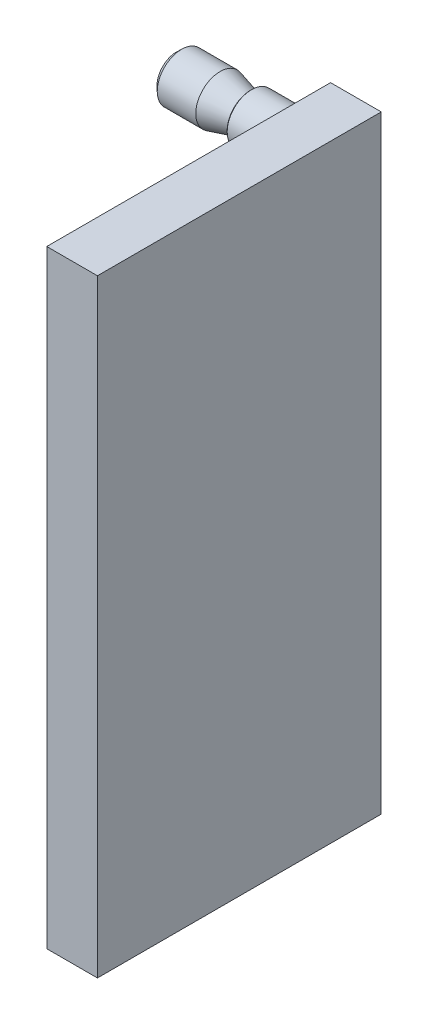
ISO-10303-21;
HEADER;
FILE_DESCRIPTION(('STEP AP214'),'2;1');
FILE_NAME('part.step','',(''),(''),'','','');
FILE_SCHEMA(('AUTOMOTIVE_DESIGN { 1 0 10303 214 1 1 1 1 }'));
ENDSEC;
DATA;
#1=APPLICATION_CONTEXT('core data for automotive mechanical design processes');
#2=APPLICATION_PROTOCOL_DEFINITION('international standard','automotive_design',2000,#1);
#3=PRODUCT_CONTEXT('',#1,'mechanical');
#4=PRODUCT('Part','Part','',(#3));
#5=PRODUCT_RELATED_PRODUCT_CATEGORY('part','',(#4));
#6=PRODUCT_DEFINITION_FORMATION('','',#4);
#7=PRODUCT_DEFINITION_CONTEXT('part definition',#1,'design');
#8=PRODUCT_DEFINITION('design','',#6,#7);
#9=PRODUCT_DEFINITION_SHAPE('','',#8);
#10=(LENGTH_UNIT() NAMED_UNIT(*) SI_UNIT(.MILLI.,.METRE.));
#11=(NAMED_UNIT(*) PLANE_ANGLE_UNIT() SI_UNIT($,.RADIAN.));
#12=(NAMED_UNIT(*) SI_UNIT($,.STERADIAN.) SOLID_ANGLE_UNIT());
#13=UNCERTAINTY_MEASURE_WITH_UNIT(LENGTH_MEASURE(1.E-05),#10,'distance_accuracy_value','');
#14=(GEOMETRIC_REPRESENTATION_CONTEXT(3) GLOBAL_UNCERTAINTY_ASSIGNED_CONTEXT((#13)) GLOBAL_UNIT_ASSIGNED_CONTEXT((#10,
#11,#12)) REPRESENTATION_CONTEXT('',''));
#15=CARTESIAN_POINT('',(0.,0.,0.));
#16=DIRECTION('',(0.,0.,1.));
#17=DIRECTION('',(1.,0.,0.));
#18=AXIS2_PLACEMENT_3D('',#15,#16,#17);
#19=CARTESIAN_POINT('',(-18.6839446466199,25.,1.90021068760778));
#20=DIRECTION('',(1.,0.,0.));
#21=DIRECTION('',(0.,0.,-1.));
#22=AXIS2_PLACEMENT_3D('',#19,#20,#21);
#23=CONICAL_SURFACE('',#22,1.34162516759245,0.991977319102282);
#24=CARTESIAN_POINT('',(-18.6839446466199,25.,1.90021068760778));
#25=DIRECTION('',(1.,0.,0.));
#26=DIRECTION('',(0.,0.,-1.));
#27=AXIS2_PLACEMENT_3D('',#24,#25,#26);
#28=CIRCLE('',#27,1.34162516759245);
#29=CARTESIAN_POINT('',(-18.68394464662,25.,0.558585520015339));
#30=VERTEX_POINT('',#29);
#31=EDGE_CURVE('E272',#30,#30,#28,.T.);
#32=ORIENTED_EDGE('',*,*,#31,.T.);
#33=EDGE_LOOP('',(#32));
#34=FACE_BOUND('',#33,.T.);
#35=CARTESIAN_POINT('',(-15.1519110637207,18.526560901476,0.));
#36=CARTESIAN_POINT('',(-15.2544568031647,18.6901191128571,0.));
#37=CARTESIAN_POINT('',(-15.356794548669,18.8538083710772,0.));
#38=CARTESIAN_POINT('',(-15.5609170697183,19.1815403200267,0.));
#39=CARTESIAN_POINT('',(-15.6627018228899,19.3455830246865,0.));
#40=CARTESIAN_POINT('',(-15.8657664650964,19.6744131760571,0.));
#41=CARTESIAN_POINT('',(-15.9670450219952,19.8392014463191,0.));
#42=CARTESIAN_POINT('',(-16.168685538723,20.1693317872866,0.));
#43=CARTESIAN_POINT('',(-16.269047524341,20.3346738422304,0.));
#44=CARTESIAN_POINT('',(-16.4827361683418,20.6896316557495,0.));
#45=CARTESIAN_POINT('',(-16.5958788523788,20.8793584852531,0.));
#46=CARTESIAN_POINT('',(-16.819916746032,21.2601620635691,0.));
#47=CARTESIAN_POINT('',(-16.930811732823,21.451238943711,0.));
#48=CARTESIAN_POINT('',(-17.149140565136,21.8351309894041,0.));
#49=CARTESIAN_POINT('',(-17.2565776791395,22.0279442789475,0.));
#50=CARTESIAN_POINT('',(-17.4137169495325,22.3193144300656,0.));
#51=CARTESIAN_POINT('',(-17.4654235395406,22.416788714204,0.));
#52=CARTESIAN_POINT('',(-17.5670981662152,22.6126378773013,0.));
#53=CARTESIAN_POINT('',(-17.6170662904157,22.7110127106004,0.));
#54=CARTESIAN_POINT('',(-17.7049791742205,22.8891261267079,0.));
#55=CARTESIAN_POINT('',(-17.7433321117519,22.968662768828,0.));
#56=CARTESIAN_POINT('',(-17.8182108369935,23.1285975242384,0.));
#57=CARTESIAN_POINT('',(-17.8547365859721,23.208995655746,0.));
#58=CARTESIAN_POINT('',(-17.92551554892,23.3709076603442,0.));
#59=CARTESIAN_POINT('',(-17.9597659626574,23.4524227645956,0.));
#60=CARTESIAN_POINT('',(-18.0253036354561,23.616644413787,0.));
#61=CARTESIAN_POINT('',(-18.0565909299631,23.6993509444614,0.));
#62=CARTESIAN_POINT('',(-18.1142915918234,23.863044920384,0.));
#63=CARTESIAN_POINT('',(-18.1408419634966,23.9439835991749,0.));
#64=CARTESIAN_POINT('',(-18.1895109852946,24.1072073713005,0.));
#65=CARTESIAN_POINT('',(-18.2116293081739,24.1894925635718,0.));
#66=CARTESIAN_POINT('',(-18.2503349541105,24.3551459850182,0.));
#67=CARTESIAN_POINT('',(-18.2669367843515,24.4385107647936,0.));
#68=CARTESIAN_POINT('',(-18.2936529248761,24.6062533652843,0.));
#69=CARTESIAN_POINT('',(-18.3037705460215,24.6906306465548,0.));
#70=CARTESIAN_POINT('',(-18.3165443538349,24.8570999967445,0.));
#71=CARTESIAN_POINT('',(-18.3194404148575,24.9391732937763,0.));
#72=CARTESIAN_POINT('',(-18.3182429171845,25.103286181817,0.));
#73=CARTESIAN_POINT('',(-18.3141477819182,25.1853257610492,0.));
#74=CARTESIAN_POINT('',(-18.2991464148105,25.3502984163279,0.));
#75=CARTESIAN_POINT('',(-18.2881155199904,25.4332199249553,0.));
#76=CARTESIAN_POINT('',(-18.2599254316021,25.5979651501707,0.));
#77=CARTESIAN_POINT('',(-18.2427679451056,25.679789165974,0.));
#78=CARTESIAN_POINT('',(-18.1895405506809,25.8989115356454,0.));
#79=CARTESIAN_POINT('',(-18.1486323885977,26.035026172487,0.));
#80=CARTESIAN_POINT('',(-18.0565914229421,26.3038052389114,0.));
#81=CARTESIAN_POINT('',(-18.0054451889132,26.4364648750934,0.));
#82=CARTESIAN_POINT('',(-17.8959561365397,26.6997303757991,0.));
#83=CARTESIAN_POINT('',(-17.8375695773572,26.8303177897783,0.));
#84=CARTESIAN_POINT('',(-17.7161155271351,27.0891883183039,0.));
#85=CARTESIAN_POINT('',(-17.6530504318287,27.2174725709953,0.));
#86=CARTESIAN_POINT('',(-17.5274938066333,27.4647652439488,0.));
#87=CARTESIAN_POINT('',(-17.4651921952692,27.5838707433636,0.));
#88=CARTESIAN_POINT('',(-17.3384536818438,27.8209571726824,0.));
#89=CARTESIAN_POINT('',(-17.2740164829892,27.9389379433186,0.));
#90=CARTESIAN_POINT('',(-17.1444746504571,28.1723618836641,0.));
#91=CARTESIAN_POINT('',(-17.0793921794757,28.2878173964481,0.));
#92=CARTESIAN_POINT('',(-16.9480410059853,28.5180120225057,0.));
#93=CARTESIAN_POINT('',(-16.8817726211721,28.6327513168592,0.));
#94=CARTESIAN_POINT('',(-16.8150715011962,28.7472339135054,0.));
#95=B_SPLINE_CURVE_WITH_KNOTS('',3,(#35,#36,#37,#38,#39,#40,#41,#42,#43,#44,#45,#46,#47,#48,#49,
#50,#51,#52,#53,#54,#55,#56,#57,#58,#59,#60,#61,#62,#63,#64,#65,#66,#67,#68,#69,#70,#71,#72,#73,
#74,#75,#76,#77,#78,#79,#80,#81,#82,#83,#84,#85,#86,#87,#88,#89,#90,#91,#92,#93,#94),
.UNSPECIFIED.,.F.,.F.,(4,2,2,2,2,2,2,2,2,2,2,2,2,2,2,2,2,2,2,2,2,2,2,2,2,2,2,2,2,4),(0.,
0.579139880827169,1.15830302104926,1.73857010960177,2.31882082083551,2.98151411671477,
3.64427279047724,4.30638541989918,4.63739156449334,4.9683810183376,5.23326542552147,
5.4981554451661,5.76336564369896,6.02857266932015,6.28401860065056,6.5394833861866,
6.79427093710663,7.04892828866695,7.29500689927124,7.54114100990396,7.79183079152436,
8.04245077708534,8.46817320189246,8.89445779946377,9.32345613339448,9.75223628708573,
10.1554558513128,10.5587316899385,10.9563309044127,11.3538251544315),.UNSPECIFIED.);
#96=CARTESIAN_POINT('',(-18.3067449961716,24.7332646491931,0.));
#97=VERTEX_POINT('',#96);
#98=CARTESIAN_POINT('',(-18.3067449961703,25.2667353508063,0.));
#99=VERTEX_POINT('',#98);
#100=EDGE_CURVE('E184',#97,#99,#95,.T.);
#101=ORIENTED_EDGE('',*,*,#100,.F.);
#102=CARTESIAN_POINT('',(-18.3067449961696,25.,1.90021068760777));
#103=DIRECTION('',(1.,0.,0.));
#104=DIRECTION('',(0.,0.,-1.));
#105=AXIS2_PLACEMENT_3D('',#102,#103,#104);
#106=CIRCLE('',#105,1.91884038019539);
#107=EDGE_CURVE('E269',#99,#97,#106,.T.);
#108=ORIENTED_EDGE('',*,*,#107,.F.);
#109=EDGE_LOOP('',(#101,#108));
#110=FACE_BOUND('',#109,.T.);
#111=ADVANCED_FACE('F14',(#34,#110),#23,.T.);
#112=CARTESIAN_POINT('',(-18.3067449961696,25.,1.90021068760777));
#113=DIRECTION('',(1.,0.,0.));
#114=DIRECTION('',(0.,0.,-1.));
#115=AXIS2_PLACEMENT_3D('',#112,#113,#114);
#116=CONICAL_SURFACE('',#115,1.91884038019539,0.760039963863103);
#117=CARTESIAN_POINT('',(-15.8429667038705,21.186469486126,0.));
#118=CARTESIAN_POINT('',(-15.9244436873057,21.2730100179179,0.));
#119=CARTESIAN_POINT('',(-16.0056414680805,21.3598157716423,0.));
#120=CARTESIAN_POINT('',(-16.1673304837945,21.5340975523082,0.));
#121=CARTESIAN_POINT('',(-16.2478216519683,21.6215736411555,0.));
#122=CARTESIAN_POINT('',(-16.4082385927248,21.7976541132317,0.));
#123=CARTESIAN_POINT('',(-16.4881610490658,21.8862615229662,0.));
#124=CARTESIAN_POINT('',(-16.6469021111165,22.0644545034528,0.));
#125=CARTESIAN_POINT('',(-16.7257207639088,22.1540400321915,0.));
#126=CARTESIAN_POINT('',(-16.8862388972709,22.3393718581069,0.));
#127=CARTESIAN_POINT('',(-16.9678594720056,22.4351866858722,0.));
#128=CARTESIAN_POINT('',(-17.1290377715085,22.6285343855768,0.));
#129=CARTESIAN_POINT('',(-17.2085956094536,22.7260671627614,0.));
#130=CARTESIAN_POINT('',(-17.3647943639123,22.9232068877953,0.));
#131=CARTESIAN_POINT('',(-17.4414395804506,23.0228104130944,0.));
#132=CARTESIAN_POINT('',(-17.5908182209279,23.224894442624,0.));
#133=CARTESIAN_POINT('',(-17.6635528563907,23.3273740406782,0.));
#134=CARTESIAN_POINT('',(-17.7826268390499,23.505201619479,0.));
#135=CARTESIAN_POINT('',(-17.8303984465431,23.579585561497,0.));
#136=CARTESIAN_POINT('',(-17.9222269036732,23.7306697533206,0.));
#137=CARTESIAN_POINT('',(-17.9662823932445,23.8073708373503,0.));
#138=CARTESIAN_POINT('',(-18.0490652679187,23.9629040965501,0.));
#139=CARTESIAN_POINT('',(-18.0878300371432,24.0417160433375,0.));
#140=CARTESIAN_POINT('',(-18.1586730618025,24.2022431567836,0.));
#141=CARTESIAN_POINT('',(-18.1907563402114,24.2839560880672,0.));
#142=CARTESIAN_POINT('',(-18.2533239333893,24.4723127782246,0.));
#143=CARTESIAN_POINT('',(-18.2811927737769,24.5798849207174,0.));
#144=CARTESIAN_POINT('',(-18.308996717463,24.7434001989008,0.));
#145=CARTESIAN_POINT('',(-18.3159315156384,24.7981871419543,0.));
#146=CARTESIAN_POINT('',(-18.3248406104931,24.9081756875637,0.));
#147=CARTESIAN_POINT('',(-18.3268150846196,24.9633772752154,0.));
#148=CARTESIAN_POINT('',(-18.3256816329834,25.0738598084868,0.));
#149=CARTESIAN_POINT('',(-18.3225613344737,25.1291406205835,0.));
#150=CARTESIAN_POINT('',(-18.311392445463,25.239197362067,0.));
#151=CARTESIAN_POINT('',(-18.3033435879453,25.2939732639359,0.));
#152=CARTESIAN_POINT('',(-18.2826932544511,25.4028483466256,0.));
#153=CARTESIAN_POINT('',(-18.2700758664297,25.456944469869,0.));
#154=CARTESIAN_POINT('',(-18.2408458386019,25.5640342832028,0.));
#155=CARTESIAN_POINT('',(-18.2242328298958,25.6170278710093,0.));
#156=CARTESIAN_POINT('',(-18.1667948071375,25.7813573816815,0.));
#157=CARTESIAN_POINT('',(-18.1199052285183,25.8905764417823,0.));
#158=CARTESIAN_POINT('',(-18.0156354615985,26.103898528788,0.));
#159=CARTESIAN_POINT('',(-17.9582364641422,26.2079919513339,0.));
#160=CARTESIAN_POINT('',(-17.8355618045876,26.4134252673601,0.));
#161=CARTESIAN_POINT('',(-17.7701842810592,26.5147036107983,0.));
#162=CARTESIAN_POINT('',(-17.6684659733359,26.6640270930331,0.));
#163=CARTESIAN_POINT('',(-17.6339652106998,26.7133507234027,0.));
#164=CARTESIAN_POINT('',(-17.5639260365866,26.8112542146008,0.));
#165=CARTESIAN_POINT('',(-17.5283876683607,26.8598341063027,0.));
#166=CARTESIAN_POINT('',(-17.4096286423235,27.0191560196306,0.));
#167=CARTESIAN_POINT('',(-17.3245487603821,27.128511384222,0.));
#168=CARTESIAN_POINT('',(-17.1512192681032,27.3446890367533,0.));
#169=CARTESIAN_POINT('',(-17.0629690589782,27.4515108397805,0.));
#170=CARTESIAN_POINT('',(-16.8841371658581,27.6632831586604,0.));
#171=CARTESIAN_POINT('',(-16.7935541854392,27.768232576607,0.));
#172=CARTESIAN_POINT('',(-16.6106857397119,27.9766402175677,0.));
#173=CARTESIAN_POINT('',(-16.5184002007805,28.0800983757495,0.));
#174=CARTESIAN_POINT('',(-16.2391330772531,28.389277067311,0.));
#175=CARTESIAN_POINT('',(-16.0502168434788,28.5932478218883,0.));
#176=CARTESIAN_POINT('',(-15.6692979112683,28.998133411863,0.));
#177=CARTESIAN_POINT('',(-15.4772962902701,29.1990492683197,0.));
#178=CARTESIAN_POINT('',(-15.1148041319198,29.5743769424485,0.));
#179=CARTESIAN_POINT('',(-14.9445563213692,29.7490235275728,0.));
#180=CARTESIAN_POINT('',(-14.6028578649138,30.0971696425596,0.));
#181=CARTESIAN_POINT('',(-14.4314070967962,30.2706690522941,0.));
#182=CARTESIAN_POINT('',(-14.0884738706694,30.6159266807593,0.));
#183=CARTESIAN_POINT('',(-13.9169958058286,30.7876892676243,0.));
#184=CARTESIAN_POINT('',(-13.5733733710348,31.1305045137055,0.));
#185=CARTESIAN_POINT('',(-13.4012290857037,31.3015572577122,0.));
#186=CARTESIAN_POINT('',(-13.2288360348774,31.4723573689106,0.));
#187=B_SPLINE_CURVE_WITH_KNOTS('',3,(#117,#118,#119,#120,#121,#122,#123,#124,#125,#126,#127,
#128,#129,#130,#131,#132,#133,#134,#135,#136,#137,#138,#139,#140,#141,#142,#143,#144,#145,#146,
#147,#148,#149,#150,#151,#152,#153,#154,#155,#156,#157,#158,#159,#160,#161,#162,#163,#164,#165,
#166,#167,#168,#169,#170,#171,#172,#173,#174,#175,#176,#177,#178,#179,#180,#181,#182,#183,#184,
#185,#186),.UNSPECIFIED.,.F.,.F.,(4,2,2,2,2,2,2,2,2,2,2,2,2,2,2,2,2,2,2,2,2,2,2,2,2,2,2,2,2,2,2,
2,2,2,4),(0.,0.356582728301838,0.713198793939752,1.0711716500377,1.42912919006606,
1.80670775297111,2.18426555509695,2.56124239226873,2.93810175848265,3.20322959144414,
3.4684540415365,3.73169490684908,3.99473715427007,4.32661386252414,4.49209272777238,
4.6575656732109,4.82344107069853,4.98932545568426,5.15579325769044,5.32227643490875,
5.67789990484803,6.034166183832,6.39558215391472,6.5761508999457,6.75671212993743,
7.17227683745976,7.58792045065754,8.00380026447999,8.41969810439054,9.25368397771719,
10.0873846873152,10.8190678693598,11.5508264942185,12.2789479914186,13.0069798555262),.UNSPECIFIED.);
#188=CARTESIAN_POINT('',(-17.8004213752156,23.5337970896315,2.64465218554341E-13));
#189=VERTEX_POINT('',#188);
#190=EDGE_CURVE('E188',#189,#97,#187,.T.);
#191=ORIENTED_EDGE('',*,*,#190,.F.);
#192=CARTESIAN_POINT('',(-17.8004213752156,25.,1.90021068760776));
#193=DIRECTION('',(1.,0.,0.));
#194=DIRECTION('',(0.,0.,-1.));
#195=AXIS2_PLACEMENT_3D('',#192,#193,#194);
#196=CIRCLE('',#195,2.40011492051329);
#197=CARTESIAN_POINT('',(-17.8004213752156,26.4662029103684,2.64465218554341E-13));
#198=VERTEX_POINT('',#197);
#199=EDGE_CURVE('E266',#198,#189,#196,.T.);
#200=ORIENTED_EDGE('',*,*,#199,.F.);
#201=EDGE_CURVE('E418',#99,#198,#187,.T.);
#202=ORIENTED_EDGE('',*,*,#201,.F.);
#203=ORIENTED_EDGE('',*,*,#107,.T.);
#204=EDGE_LOOP('',(#191,#200,#202,#203));
#205=FACE_BOUND('',#204,.T.);
#206=ADVANCED_FACE('F425',(#205),#116,.T.);
#207=CARTESIAN_POINT('',(-5.,25.,1.9002106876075));
#208=DIRECTION('',(1.,0.,0.));
#209=DIRECTION('',(0.,0.,-1.));
#210=AXIS2_PLACEMENT_3D('',#207,#208,#209);
#211=CYLINDRICAL_SURFACE('',#210,2.40011492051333);
#212=DIRECTION('',(1.,0.,0.));
#213=VECTOR('',#212,1.);
#214=CARTESIAN_POINT('',(-5.,26.4662029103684,0.));
#215=LINE('',#214,#213);
#216=CARTESIAN_POINT('',(-14.0005746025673,26.4662029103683,0.));
#217=VERTEX_POINT('',#216);
#218=EDGE_CURVE('E35',#198,#217,#215,.T.);
#219=ORIENTED_EDGE('',*,*,#218,.F.);
#220=ORIENTED_EDGE('',*,*,#199,.T.);
#221=DIRECTION('',(1.,0.,0.));
#222=VECTOR('',#221,1.);
#223=CARTESIAN_POINT('',(-5.,23.5337970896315,0.));
#224=LINE('',#223,#222);
#225=CARTESIAN_POINT('',(-14.0005746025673,23.5337970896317,0.));
#226=VERTEX_POINT('',#225);
#227=EDGE_CURVE('E574',#226,#189,#224,.F.);
#228=ORIENTED_EDGE('',*,*,#227,.F.);
#229=CARTESIAN_POINT('',(-14.0005746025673,25.,1.90021068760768));
#230=DIRECTION('',(1.,0.,0.));
#231=DIRECTION('',(0.,0.,-1.));
#232=AXIS2_PLACEMENT_3D('',#229,#230,#231);
#233=CIRCLE('',#232,2.40011492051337);
#234=EDGE_CURVE('E263',#217,#226,#233,.T.);
#235=ORIENTED_EDGE('',*,*,#234,.F.);
#236=EDGE_LOOP('',(#219,#220,#228,#235));
#237=FACE_BOUND('',#236,.T.);
#238=ADVANCED_FACE('F429',(#237),#211,.T.);
#239=CARTESIAN_POINT('',(-14.0005746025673,25.,1.90021068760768));
#240=DIRECTION('',(-1.,0.,0.));
#241=DIRECTION('',(0.,0.,1.));
#242=AXIS2_PLACEMENT_3D('',#239,#240,#241);
#243=CONICAL_SURFACE('',#242,2.40011492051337,0.26176095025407);
#244=CARTESIAN_POINT('',(-11.3775138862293,25.,1.90021068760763));
#245=DIRECTION('',(1.,0.,0.));
#246=DIRECTION('',(0.,0.,-1.));
#247=AXIS2_PLACEMENT_3D('',#244,#245,#246);
#248=CIRCLE('',#247,1.69737598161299);
#249=CARTESIAN_POINT('',(-11.3775138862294,25.,0.20283470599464));
#250=VERTEX_POINT('',#249);
#251=EDGE_CURVE('E260',#250,#250,#248,.T.);
#252=ORIENTED_EDGE('',*,*,#251,.F.);
#253=EDGE_LOOP('',(#252));
#254=FACE_BOUND('',#253,.T.);
#255=CARTESIAN_POINT('',(-16.9489185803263,22.4377161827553,0.));
#256=CARTESIAN_POINT('',(-16.805299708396,22.4856277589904,0.));
#257=CARTESIAN_POINT('',(-16.661817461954,22.5339535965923,0.));
#258=CARTESIAN_POINT('',(-16.3751901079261,22.6316250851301,0.));
#259=CARTESIAN_POINT('',(-16.2320450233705,22.6809708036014,0.));
#260=CARTESIAN_POINT('',(-15.9458405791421,22.7809838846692,0.));
#261=CARTESIAN_POINT('',(-15.8027822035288,22.831654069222,0.));
#262=CARTESIAN_POINT('',(-15.5171990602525,22.9344652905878,0.));
#263=CARTESIAN_POINT('',(-15.3746742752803,22.9866062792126,0.));
#264=CARTESIAN_POINT('',(-15.0903534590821,23.092689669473,0.));
#265=CARTESIAN_POINT('',(-14.9485571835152,23.1466314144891,0.));
#266=CARTESIAN_POINT('',(-14.665861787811,23.2568144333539,0.));
#267=CARTESIAN_POINT('',(-14.524962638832,23.3130556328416,0.));
#268=CARTESIAN_POINT('',(-14.2445230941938,23.4284834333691,0.));
#269=CARTESIAN_POINT('',(-14.104981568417,23.4876672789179,0.));
#270=CARTESIAN_POINT('',(-13.8276830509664,23.6100585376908,0.));
#271=CARTESIAN_POINT('',(-13.6899256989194,23.6732651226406,0.));
#272=CARTESIAN_POINT('',(-13.5019114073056,23.7643878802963,0.));
#273=CARTESIAN_POINT('',(-13.4504591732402,23.7898352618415,0.));
#274=CARTESIAN_POINT('',(-13.3480488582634,23.8417108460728,0.));
#275=CARTESIAN_POINT('',(-13.2970908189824,23.8681391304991,0.));
#276=CARTESIAN_POINT('',(-13.1448063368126,23.9492876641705,0.));
#277=CARTESIAN_POINT('',(-13.0443691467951,24.005728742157,0.));
#278=CARTESIAN_POINT('',(-12.8970267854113,24.0951935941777,0.));
#279=CARTESIAN_POINT('',(-12.8486046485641,24.1257174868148,0.));
#280=CARTESIAN_POINT('',(-12.7531191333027,24.1888121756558,0.));
#281=CARTESIAN_POINT('',(-12.706055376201,24.2213823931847,0.));
#282=CARTESIAN_POINT('',(-12.6139846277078,24.2889782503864,0.));
#283=CARTESIAN_POINT('',(-12.568970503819,24.3239940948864,0.));
#284=CARTESIAN_POINT('',(-12.4817133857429,24.3972933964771,0.));
#285=CARTESIAN_POINT('',(-12.4394671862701,24.4355729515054,0.));
#286=CARTESIAN_POINT('',(-12.3706621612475,24.5049212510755,0.));
#287=CARTESIAN_POINT('',(-12.3430593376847,24.5349437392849,0.));
#288=CARTESIAN_POINT('',(-12.2909410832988,24.5976912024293,0.));
#289=CARTESIAN_POINT('',(-12.2664306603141,24.6304204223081,0.));
#290=CARTESIAN_POINT('',(-12.2216794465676,24.6994074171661,0.));
#291=CARTESIAN_POINT('',(-12.201502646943,24.7357078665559,0.));
#292=CARTESIAN_POINT('',(-12.1681225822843,24.8113664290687,0.));
#293=CARTESIAN_POINT('',(-12.1548910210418,24.8507113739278,0.));
#294=CARTESIAN_POINT('',(-12.140119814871,24.9198153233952,0.));
#295=CARTESIAN_POINT('',(-12.1363151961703,24.9490870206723,0.));
#296=CARTESIAN_POINT('',(-12.1338345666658,25.0078574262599,0.));
#297=CARTESIAN_POINT('',(-12.135158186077,25.0373561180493,0.));
#298=CARTESIAN_POINT('',(-12.1427587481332,25.0955935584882,0.));
#299=CARTESIAN_POINT('',(-12.1490203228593,25.1243343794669,0.));
#300=CARTESIAN_POINT('',(-12.1657871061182,25.1805268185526,0.));
#301=CARTESIAN_POINT('',(-12.1762945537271,25.2079777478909,0.));
#302=CARTESIAN_POINT('',(-12.2085386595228,25.2784775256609,0.));
#303=CARTESIAN_POINT('',(-12.2331503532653,25.320197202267,0.));
#304=CARTESIAN_POINT('',(-12.2882616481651,25.3995735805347,0.));
#305=CARTESIAN_POINT('',(-12.3187845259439,25.4372132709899,0.));
#306=CARTESIAN_POINT('',(-12.3955189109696,25.5223080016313,0.));
#307=CARTESIAN_POINT('',(-12.4433655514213,25.5682652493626,0.));
#308=CARTESIAN_POINT('',(-12.5431923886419,25.6555100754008,0.));
#309=CARTESIAN_POINT('',(-12.5951815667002,25.6967870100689,0.));
#310=CARTESIAN_POINT('',(-12.702417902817,25.7762983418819,0.));
#311=CARTESIAN_POINT('',(-12.7576975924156,25.8144884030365,0.));
#312=CARTESIAN_POINT('',(-12.869981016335,25.8880613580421,0.));
#313=CARTESIAN_POINT('',(-12.9269826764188,25.9234474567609,0.));
#314=CARTESIAN_POINT('',(-13.0520687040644,25.9979044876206,0.));
#315=CARTESIAN_POINT('',(-13.1203884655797,26.0365778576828,0.));
#316=CARTESIAN_POINT('',(-13.2582754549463,26.1116425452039,0.));
#317=CARTESIAN_POINT('',(-13.3278429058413,26.1480334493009,0.));
#318=CARTESIAN_POINT('',(-13.5380001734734,26.2545488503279,0.));
#319=CARTESIAN_POINT('',(-13.6799587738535,26.321966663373,0.));
#320=CARTESIAN_POINT('',(-13.9665614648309,26.45218372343,0.));
#321=CARTESIAN_POINT('',(-14.1112134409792,26.5149652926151,0.));
#322=CARTESIAN_POINT('',(-14.4019392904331,26.6369726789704,0.));
#323=CARTESIAN_POINT('',(-14.5480126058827,26.696199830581,0.));
#324=CARTESIAN_POINT('',(-14.8240709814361,26.8052321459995,0.));
#325=CARTESIAN_POINT('',(-14.9539413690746,26.855329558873,0.));
#326=CARTESIAN_POINT('',(-15.2143243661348,26.9538693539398,0.));
#327=CARTESIAN_POINT('',(-15.3448370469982,27.0023115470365,0.));
#328=CARTESIAN_POINT('',(-15.6054210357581,27.0975020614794,0.));
#329=CARTESIAN_POINT('',(-15.7354888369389,27.1442600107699,0.));
#330=CARTESIAN_POINT('',(-15.9959998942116,27.236648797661,0.));
#331=CARTESIAN_POINT('',(-16.1264430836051,27.2822798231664,0.));
#332=CARTESIAN_POINT('',(-16.257040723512,27.3274583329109,0.));
#333=B_SPLINE_CURVE_WITH_KNOTS('',3,(#255,#256,#257,#258,#259,#260,#261,#262,#263,#264,#265,
#266,#267,#268,#269,#270,#271,#272,#273,#274,#275,#276,#277,#278,#279,#280,#281,#282,#283,#284,
#285,#286,#287,#288,#289,#290,#291,#292,#293,#294,#295,#296,#297,#298,#299,#300,#301,#302,#303,
#304,#305,#306,#307,#308,#309,#310,#311,#312,#313,#314,#315,#316,#317,#318,#319,#320,#321,#322,
#323,#324,#325,#326,#327,#328,#329,#330,#331,#332),.UNSPECIFIED.,.F.,.F.,(4,2,2,2,2,2,2,2,2,2,2,
2,2,2,2,2,2,2,2,2,2,2,2,2,2,2,2,2,2,2,2,2,2,2,2,2,2,2,4),(0.,0.454201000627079,
0.908432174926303,1.3637260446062,1.8190050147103,2.27411974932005,2.72921977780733,
3.18390139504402,3.63848969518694,3.81068310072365,3.98289088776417,4.3283017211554,
4.49998452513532,4.67161899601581,4.84260162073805,5.01338261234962,5.13558373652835,
5.25798028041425,5.38207585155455,5.50566183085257,5.59380081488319,5.68193344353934,
5.76979286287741,5.85769867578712,6.00216838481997,6.14721898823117,6.34574962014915,
6.54472304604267,6.74617654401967,6.9473963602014,7.18285547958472,7.41835711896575,
7.8896578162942,8.3626715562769,8.83550658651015,9.25308792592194,9.67071681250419,
10.0853624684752,10.4999385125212),.UNSPECIFIED.);
#334=EDGE_CURVE('E411',#217,#226,#333,.F.);
#335=ORIENTED_EDGE('',*,*,#334,.F.);
#336=ORIENTED_EDGE('',*,*,#234,.T.);
#337=EDGE_LOOP('',(#335,#336));
#338=FACE_BOUND('',#337,.T.);
#339=ADVANCED_FACE('F548',(#254,#338),#243,.T.);
#340=CARTESIAN_POINT('',(-11.0235946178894,25.,1.90021068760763));
#341=DIRECTION('',(1.,0.,0.));
#342=DIRECTION('',(0.,0.,-1.));
#343=AXIS2_PLACEMENT_3D('',#340,#341,#342);
#344=CONICAL_SURFACE('',#343,1.87029544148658,1.37127084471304);
#345=CARTESIAN_POINT('',(-11.0235946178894,25.,1.90021068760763));
#346=DIRECTION('',(1.,0.,0.));
#347=DIRECTION('',(0.,0.,-1.));
#348=AXIS2_PLACEMENT_3D('',#345,#346,#347);
#349=CIRCLE('',#348,1.87029544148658);
#350=CARTESIAN_POINT('',(-11.0235946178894,25.,0.0299152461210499));
#351=VERTEX_POINT('',#350);
#352=EDGE_CURVE('E248',#351,#351,#349,.T.);
#353=ORIENTED_EDGE('',*,*,#352,.T.);
#354=EDGE_LOOP('',(#353));
#355=FACE_BOUND('',#354,.T.);
#356=CARTESIAN_POINT('',(-10.7191824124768,22.2099480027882,0.));
#357=CARTESIAN_POINT('',(-10.7334022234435,22.2950421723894,0.));
#358=CARTESIAN_POINT('',(-10.7474266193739,22.3801690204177,0.));
#359=CARTESIAN_POINT('',(-10.7749869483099,22.550504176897,0.));
#360=CARTESIAN_POINT('',(-10.7885228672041,22.6357124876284,0.));
#361=CARTESIAN_POINT('',(-10.828273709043,22.8916275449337,0.));
#362=CARTESIAN_POINT('',(-10.8536061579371,23.0624735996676,0.));
#363=CARTESIAN_POINT('',(-10.9005638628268,23.4035386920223,0.));
#364=CARTESIAN_POINT('',(-10.9222124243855,23.5737544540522,0.));
#365=CARTESIAN_POINT('',(-10.9602262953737,23.914731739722,0.));
#366=CARTESIAN_POINT('',(-10.9765935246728,24.0854930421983,0.));
#367=CARTESIAN_POINT('',(-11.0018336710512,24.4284506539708,0.));
#368=CARTESIAN_POINT('',(-11.01066954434,24.6006498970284,0.));
#369=CARTESIAN_POINT('',(-11.0168838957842,24.8591285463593,0.));
#370=CARTESIAN_POINT('',(-11.0177817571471,24.9453294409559,0.));
#371=CARTESIAN_POINT('',(-11.0172030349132,25.1177216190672,0.));
#372=CARTESIAN_POINT('',(-11.0157264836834,25.2039129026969,0.));
#373=CARTESIAN_POINT('',(-11.0077980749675,25.4634004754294,0.));
#374=CARTESIAN_POINT('',(-10.9978239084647,25.6365967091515,0.));
#375=CARTESIAN_POINT('',(-10.977286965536,25.8959188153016,0.));
#376=CARTESIAN_POINT('',(-10.9695110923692,25.9822885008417,0.));
#377=CARTESIAN_POINT('',(-10.9524005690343,26.1548576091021,0.));
#378=CARTESIAN_POINT('',(-10.9430662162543,26.241057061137,0.));
#379=CARTESIAN_POINT('',(-10.9331010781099,26.3271840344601,0.));
#380=B_SPLINE_CURVE_WITH_KNOTS('',3,(#356,#357,#358,#359,#360,#361,#362,#363,#364,#365,#366,
#367,#368,#369,#370,#371,#372,#373,#374,#375,#376,#377,#378,#379),.UNSPECIFIED.,.F.,.F.,(4,2,2,
2,2,2,2,2,2,2,2,4),(0.,0.258821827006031,0.517651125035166,1.0357685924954,1.55047545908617,
2.06499500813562,2.58203090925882,2.84061707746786,3.09919972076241,3.61940295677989,
3.87955103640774,4.139649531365),.UNSPECIFIED.);
#381=CARTESIAN_POINT('',(-11.,24.4192490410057,0.));
#382=VERTEX_POINT('',#381);
#383=CARTESIAN_POINT('',(-11.,25.5807509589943,0.));
#384=VERTEX_POINT('',#383);
#385=EDGE_CURVE('E389',#382,#384,#380,.T.);
#386=ORIENTED_EDGE('',*,*,#385,.F.);
#387=CARTESIAN_POINT('',(-11.,25.,1.90021068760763));
#388=DIRECTION('',(1.,0.,0.));
#389=DIRECTION('',(0.,0.,-1.));
#390=AXIS2_PLACEMENT_3D('',#387,#388,#389);
#391=CIRCLE('',#390,1.98697567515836);
#392=EDGE_CURVE('E245',#384,#382,#391,.T.);
#393=ORIENTED_EDGE('',*,*,#392,.F.);
#394=EDGE_LOOP('',(#386,#393));
#395=FACE_BOUND('',#394,.T.);
#396=ADVANCED_FACE('F543',(#355,#395),#344,.T.);
#397=CARTESIAN_POINT('',(-11.,25.,3.88718636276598));
#398=DIRECTION('',(1.,0.,0.));
#399=DIRECTION('',(0.,0.,-1.));
#400=AXIS2_PLACEMENT_3D('',#397,#398,#399);
#401=PLANE('',#400);
#402=DIRECTION('',(0.,1.,0.));
#403=VECTOR('',#402,1.);
#404=CARTESIAN_POINT('',(-11.,25.,0.));
#405=LINE('',#404,#403);
#406=CARTESIAN_POINT('',(-11.,23.7039228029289,0.));
#407=VERTEX_POINT('',#406);
#408=EDGE_CURVE('E584',#407,#382,#405,.T.);
#409=ORIENTED_EDGE('',*,*,#408,.F.);
#410=CARTESIAN_POINT('',(-11.,25.,1.90021068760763));
#411=DIRECTION('',(1.,0.,0.));
#412=DIRECTION('',(0.,0.,-1.));
#413=AXIS2_PLACEMENT_3D('',#410,#411,#412);
#414=CIRCLE('',#413,2.30013407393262);
#415=CARTESIAN_POINT('',(-11.,26.2960771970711,0.));
#416=VERTEX_POINT('',#415);
#417=EDGE_CURVE('E242',#416,#407,#414,.T.);
#418=ORIENTED_EDGE('',*,*,#417,.F.);
#419=EDGE_CURVE('E586',#384,#416,#405,.T.);
#420=ORIENTED_EDGE('',*,*,#419,.F.);
#421=ORIENTED_EDGE('',*,*,#392,.T.);
#422=EDGE_LOOP('',(#409,#418,#420,#421));
#423=FACE_BOUND('',#422,.T.);
#424=ADVANCED_FACE('F539',(#423),#401,.F.);
#425=CARTESIAN_POINT('',(-11.,25.,1.90021068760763));
#426=DIRECTION('',(1.,0.,0.));
#427=DIRECTION('',(0.,0.,-1.));
#428=AXIS2_PLACEMENT_3D('',#425,#426,#427);
#429=CONICAL_SURFACE('',#428,2.30013407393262,0.78539816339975);
#430=CARTESIAN_POINT('',(-8.88399392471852,21.0135864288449,0.));
#431=CARTESIAN_POINT('',(-8.96791943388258,21.1065728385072,0.));
#432=CARTESIAN_POINT('',(-9.05155975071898,21.1998189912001,0.));
#433=CARTESIAN_POINT('',(-9.21811169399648,21.3869739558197,0.));
#434=CARTESIAN_POINT('',(-9.30102325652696,21.4808828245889,0.));
#435=CARTESIAN_POINT('',(-9.4661489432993,21.6697238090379,0.));
#436=CARTESIAN_POINT('',(-9.54836083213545,21.764657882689,0.));
#437=CARTESIAN_POINT('',(-9.71163670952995,21.9555037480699,0.));
#438=CARTESIAN_POINT('',(-9.79270074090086,22.0514155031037,0.));
#439=CARTESIAN_POINT('',(-9.95192018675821,22.2427368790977,0.));
#440=CARTESIAN_POINT('',(-10.0301016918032,22.3381247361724,0.));
#441=CARTESIAN_POINT('',(-10.1846091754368,22.5303901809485,0.));
#442=CARTESIAN_POINT('',(-10.2609352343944,22.6272677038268,0.));
#443=CARTESIAN_POINT('',(-10.411064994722,22.8228797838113,0.));
#444=CARTESIAN_POINT('',(-10.4848700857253,22.9216132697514,0.));
#445=CARTESIAN_POINT('',(-10.6290622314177,23.1215346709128,0.));
#446=CARTESIAN_POINT('',(-10.6994500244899,23.2227220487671,0.));
#447=CARTESIAN_POINT('',(-10.8218843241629,23.4079152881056,0.));
#448=CARTESIAN_POINT('',(-10.8747978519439,23.491343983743,0.));
#449=CARTESIAN_POINT('',(-10.9763413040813,23.660670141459,0.));
#450=CARTESIAN_POINT('',(-11.0249756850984,23.7465649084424,0.));
#451=CARTESIAN_POINT('',(-11.1167587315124,23.9220576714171,0.));
#452=CARTESIAN_POINT('',(-11.1598674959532,24.0116770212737,0.));
#453=CARTESIAN_POINT('',(-11.2184381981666,24.1489010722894,0.));
#454=CARTESIAN_POINT('',(-11.2369737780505,24.1951928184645,0.));
#455=CARTESIAN_POINT('',(-11.271625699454,24.2887102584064,0.));
#456=CARTESIAN_POINT('',(-11.2877401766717,24.3359366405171,0.));
#457=CARTESIAN_POINT('',(-11.3024541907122,24.3836200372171,0.));
#458=B_SPLINE_CURVE_WITH_KNOTS('',3,(#430,#431,#432,#433,#434,#435,#436,#437,#438,#439,#440,
#441,#442,#443,#444,#445,#446,#447,#448,#449,#450,#451,#452,#453,#454,#455,#456,#457),
.UNSPECIFIED.,.F.,.F.,(4,2,2,2,2,2,2,2,2,2,2,2,2,4),(0.,0.375780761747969,0.751594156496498,
1.12833815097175,1.50506805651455,1.8750517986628,2.24501948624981,2.61477983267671,
2.98445992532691,3.2807474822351,3.57672271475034,3.87472738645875,4.02426083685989,
4.17390884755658),.UNSPECIFIED.);
#459=CARTESIAN_POINT('',(-10.9000191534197,23.5337970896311,0.));
#460=VERTEX_POINT('',#459);
#461=EDGE_CURVE('E397',#460,#407,#458,.T.);
#462=ORIENTED_EDGE('',*,*,#461,.F.);
#463=CARTESIAN_POINT('',(-10.9000191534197,25.,1.90021068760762));
#464=DIRECTION('',(1.,0.,0.));
#465=DIRECTION('',(0.,0.,-1.));
#466=AXIS2_PLACEMENT_3D('',#463,#464,#465);
#467=CIRCLE('',#466,2.40011492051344);
#468=CARTESIAN_POINT('',(-10.9000191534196,26.4662029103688,1.21898319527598E-13));
#469=VERTEX_POINT('',#468);
#470=EDGE_CURVE('E239',#469,#460,#467,.T.);
#471=ORIENTED_EDGE('',*,*,#470,.F.);
#472=CARTESIAN_POINT('',(-11.3024541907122,25.6163799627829,0.));
#473=CARTESIAN_POINT('',(-11.2877401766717,25.6640633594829,0.));
#474=CARTESIAN_POINT('',(-11.271625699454,25.7112897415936,0.));
#475=CARTESIAN_POINT('',(-11.2369737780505,25.8048071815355,0.));
#476=CARTESIAN_POINT('',(-11.2184381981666,25.8510989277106,0.));
#477=CARTESIAN_POINT('',(-11.1598674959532,25.9883229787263,0.));
#478=CARTESIAN_POINT('',(-11.1167587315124,26.0779423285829,0.));
#479=CARTESIAN_POINT('',(-11.0249756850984,26.2534350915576,0.));
#480=CARTESIAN_POINT('',(-10.9763413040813,26.339329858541,0.));
#481=CARTESIAN_POINT('',(-10.8747978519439,26.508656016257,0.));
#482=CARTESIAN_POINT('',(-10.8218843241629,26.5920847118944,0.));
#483=CARTESIAN_POINT('',(-10.6994500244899,26.7772779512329,0.));
#484=CARTESIAN_POINT('',(-10.6290622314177,26.8784653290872,0.));
#485=CARTESIAN_POINT('',(-10.4848700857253,27.0783867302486,0.));
#486=CARTESIAN_POINT('',(-10.411064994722,27.1771202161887,0.));
#487=CARTESIAN_POINT('',(-10.2609352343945,27.3727322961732,0.));
#488=CARTESIAN_POINT('',(-10.1846091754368,27.4696098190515,0.));
#489=CARTESIAN_POINT('',(-10.0301016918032,27.6618752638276,0.));
#490=CARTESIAN_POINT('',(-9.95192018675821,27.7572631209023,0.));
#491=CARTESIAN_POINT('',(-9.79270074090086,27.9485844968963,0.));
#492=CARTESIAN_POINT('',(-9.71163670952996,28.0444962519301,0.));
#493=CARTESIAN_POINT('',(-9.54836083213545,28.235342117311,0.));
#494=CARTESIAN_POINT('',(-9.4661489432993,28.3302761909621,0.));
#495=CARTESIAN_POINT('',(-9.30102325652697,28.5191171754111,0.));
#496=CARTESIAN_POINT('',(-9.21811169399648,28.6130260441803,0.));
#497=CARTESIAN_POINT('',(-9.05155975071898,28.8001810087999,0.));
#498=CARTESIAN_POINT('',(-8.96791943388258,28.8934271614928,0.));
#499=CARTESIAN_POINT('',(-8.88399392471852,28.9864135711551,0.));
#500=B_SPLINE_CURVE_WITH_KNOTS('',3,(#472,#473,#474,#475,#476,#477,#478,#479,#480,#481,#482,
#483,#484,#485,#486,#487,#488,#489,#490,#491,#492,#493,#494,#495,#496,#497,#498,#499),
.UNSPECIFIED.,.F.,.F.,(4,2,2,2,2,2,2,2,2,2,2,2,2,4),(0.,0.149648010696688,0.299181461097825,
0.597186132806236,0.893161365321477,1.18944892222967,1.55912901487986,1.92888936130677,
2.29885704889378,2.66884079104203,3.04557069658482,3.42231469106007,3.79812808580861,
4.17390884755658),.UNSPECIFIED.);
#501=EDGE_CURVE('E380',#416,#469,#500,.T.);
#502=ORIENTED_EDGE('',*,*,#501,.F.);
#503=ORIENTED_EDGE('',*,*,#417,.T.);
#504=EDGE_LOOP('',(#462,#471,#502,#503));
#505=FACE_BOUND('',#504,.T.);
#506=ADVANCED_FACE('F534',(#505),#429,.T.);
#507=CARTESIAN_POINT('',(-5.,25.,1.9002106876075));
#508=DIRECTION('',(1.,0.,0.));
#509=DIRECTION('',(0.,0.,-1.));
#510=AXIS2_PLACEMENT_3D('',#507,#508,#509);
#511=CYLINDRICAL_SURFACE('',#510,2.4001149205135);
#512=DIRECTION('',(1.,0.,0.));
#513=VECTOR('',#512,1.);
#514=CARTESIAN_POINT('',(-5.,26.4662029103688,0.));
#515=LINE('',#514,#513);
#516=CARTESIAN_POINT('',(-5.09998084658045,26.4662029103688,0.));
#517=VERTEX_POINT('',#516);
#518=EDGE_CURVE('E43',#469,#517,#515,.T.);
#519=ORIENTED_EDGE('',*,*,#518,.F.);
#520=ORIENTED_EDGE('',*,*,#470,.T.);
#521=DIRECTION('',(1.,0.,0.));
#522=VECTOR('',#521,1.);
#523=CARTESIAN_POINT('',(-5.,23.5337970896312,0.));
#524=LINE('',#523,#522);
#525=CARTESIAN_POINT('',(-5.09998084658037,23.5337970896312,0.));
#526=VERTEX_POINT('',#525);
#527=EDGE_CURVE('E581',#526,#460,#524,.F.);
#528=ORIENTED_EDGE('',*,*,#527,.F.);
#529=CARTESIAN_POINT('',(-5.09998084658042,25.,1.9002106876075));
#530=DIRECTION('',(1.,0.,0.));
#531=DIRECTION('',(0.,0.,-1.));
#532=AXIS2_PLACEMENT_3D('',#529,#530,#531);
#533=CIRCLE('',#532,2.40011492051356);
#534=EDGE_CURVE('E236',#517,#526,#533,.T.);
#535=ORIENTED_EDGE('',*,*,#534,.F.);
#536=EDGE_LOOP('',(#519,#520,#528,#535));
#537=FACE_BOUND('',#536,.T.);
#538=ADVANCED_FACE('F530',(#537),#511,.T.);
#539=CARTESIAN_POINT('',(-5.09998084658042,25.,1.9002106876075));
#540=DIRECTION('',(-1.,0.,0.));
#541=DIRECTION('',(0.,0.,1.));
#542=AXIS2_PLACEMENT_3D('',#539,#540,#541);
#543=CONICAL_SURFACE('',#542,2.40011492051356,0.785398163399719);
#544=CARTESIAN_POINT('',(-4.69754581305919,24.383620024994,0.));
#545=CARTESIAN_POINT('',(-4.7122598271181,24.3359366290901,0.));
#546=CARTESIAN_POINT('',(-4.728374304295,24.2887102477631,0.));
#547=CARTESIAN_POINT('',(-4.76302622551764,24.1951928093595,0.));
#548=CARTESIAN_POINT('',(-4.78156180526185,24.1489010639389,0.));
#549=CARTESIAN_POINT('',(-4.84013250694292,24.0116770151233,0.));
#550=CARTESIAN_POINT('',(-4.88324127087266,23.9220576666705,0.));
#551=CARTESIAN_POINT('',(-4.97502431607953,23.7465649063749,0.));
#552=CARTESIAN_POINT('',(-5.0236586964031,23.6606701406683,0.));
#553=CARTESIAN_POINT('',(-5.12520214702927,23.491343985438,0.));
#554=CARTESIAN_POINT('',(-5.17811567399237,23.4079152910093,0.));
#555=CARTESIAN_POINT('',(-5.30054997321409,23.2227220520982,0.));
#556=CARTESIAN_POINT('',(-5.37093776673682,23.1215346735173,0.));
#557=CARTESIAN_POINT('',(-5.51512991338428,22.9216132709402,0.));
#558=CARTESIAN_POINT('',(-5.58893500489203,22.8228797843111,0.));
#559=CARTESIAN_POINT('',(-5.73906476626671,22.6272677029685,0.));
#560=CARTESIAN_POINT('',(-5.81539082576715,22.5303901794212,0.));
#561=CARTESIAN_POINT('',(-5.96989831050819,22.3381247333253,0.));
#562=CARTESIAN_POINT('',(-6.04807981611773,22.2427368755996,0.));
#563=CARTESIAN_POINT('',(-6.20729926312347,22.0514154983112,0.));
#564=CARTESIAN_POINT('',(-6.28836329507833,21.9555037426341,0.));
#565=CARTESIAN_POINT('',(-6.45163917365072,21.7646578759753,0.));
#566=CARTESIAN_POINT('',(-6.53385106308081,21.6697238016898,0.));
#567=CARTESIAN_POINT('',(-6.69897675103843,21.4808828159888,0.));
#568=CARTESIAN_POINT('',(-6.78188831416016,21.3869739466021,0.));
#569=CARTESIAN_POINT('',(-6.9484402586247,21.199818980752,0.));
#570=CARTESIAN_POINT('',(-7.03208057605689,21.1065728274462,0.));
#571=CARTESIAN_POINT('',(-7.11600608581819,21.0135864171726,0.));
#572=B_SPLINE_CURVE_WITH_KNOTS('',3,(#544,#545,#546,#547,#548,#549,#550,#551,#552,#553,#554,
#555,#556,#557,#558,#559,#560,#561,#562,#563,#564,#565,#566,#567,#568,#569,#570,#571),
.UNSPECIFIED.,.F.,.F.,(4,2,2,2,2,2,2,2,2,2,2,2,2,4),(0.,0.149648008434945,0.299181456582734,
0.597186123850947,0.893161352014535,1.18944890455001,1.55912899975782,1.92888934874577,
2.29885703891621,2.66884078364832,3.04557069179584,3.42231468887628,3.79812808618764,
4.17390885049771),.UNSPECIFIED.);
#573=CARTESIAN_POINT('',(-5.,23.7039228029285,0.));
#574=VERTEX_POINT('',#573);
#575=EDGE_CURVE('E405',#574,#526,#572,.T.);
#576=ORIENTED_EDGE('',*,*,#575,.F.);
#577=CARTESIAN_POINT('',(-5.,25.,1.9002106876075));
#578=DIRECTION('',(1.,0.,0.));
#579=DIRECTION('',(0.,0.,-1.));
#580=AXIS2_PLACEMENT_3D('',#577,#578,#579);
#581=CIRCLE('',#580,2.30013407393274);
#582=CARTESIAN_POINT('',(-5.00000000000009,26.2960771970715,0.));
#583=VERTEX_POINT('',#582);
#584=EDGE_CURVE('E179',#583,#574,#581,.T.);
#585=ORIENTED_EDGE('',*,*,#584,.F.);
#586=CARTESIAN_POINT('',(-7.11600608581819,28.9864135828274,0.));
#587=CARTESIAN_POINT('',(-7.03208057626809,28.8934271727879,0.));
#588=CARTESIAN_POINT('',(-6.94844025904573,28.8001810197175,0.));
#589=CARTESIAN_POINT('',(-6.78188831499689,28.6130260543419,0.));
#590=CARTESIAN_POINT('',(-6.69897675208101,28.5191171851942,0.));
#591=CARTESIAN_POINT('',(-6.53385106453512,28.3302761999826,0.));
#592=CARTESIAN_POINT('',(-6.45163917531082,28.2353421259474,0.));
#593=CARTESIAN_POINT('',(-6.28836329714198,28.0444962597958,0.));
#594=CARTESIAN_POINT('',(-6.20729926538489,27.9485845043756,0.));
#595=CARTESIAN_POINT('',(-6.04807981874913,27.7572631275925,0.));
#596=CARTESIAN_POINT('',(-5.9698983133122,27.661875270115,0.));
#597=CARTESIAN_POINT('',(-5.81539082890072,27.4696098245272,0.));
#598=CARTESIAN_POINT('',(-5.73906476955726,27.3727323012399,0.));
#599=CARTESIAN_POINT('',(-5.58893500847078,27.177120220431,0.));
#600=CARTESIAN_POINT('',(-5.51512991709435,27.0783867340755,0.));
#601=CARTESIAN_POINT('',(-5.37093777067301,26.8784653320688,0.));
#602=CARTESIAN_POINT('',(-5.3005499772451,26.7772779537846,0.));
#603=CARTESIAN_POINT('',(-5.17811567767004,26.5920847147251,0.));
#604=CARTESIAN_POINT('',(-5.12520215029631,26.5086560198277,0.));
#605=CARTESIAN_POINT('',(-5.02365869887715,26.3393298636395,0.));
#606=CARTESIAN_POINT('',(-4.97502431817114,26.2534350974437,0.));
#607=CARTESIAN_POINT('',(-4.88324127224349,26.0779423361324,0.));
#608=CARTESIAN_POINT('',(-4.84013250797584,25.9883229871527,0.));
#609=CARTESIAN_POINT('',(-4.78156180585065,25.8510989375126,0.));
#610=CARTESIAN_POINT('',(-4.76302622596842,25.8048071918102,0.));
#611=CARTESIAN_POINT('',(-4.72837430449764,25.7112897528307,0.));
#612=CARTESIAN_POINT('',(-4.71225982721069,25.6640633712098,0.));
#613=CARTESIAN_POINT('',(-4.69754581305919,25.6163799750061,0.));
#614=B_SPLINE_CURVE_WITH_KNOTS('',3,(#586,#587,#588,#589,#590,#591,#592,#593,#594,#595,#596,
#597,#598,#599,#600,#601,#602,#603,#604,#605,#606,#607,#608,#609,#610,#611,#612,#613),
.UNSPECIFIED.,.F.,.F.,(4,2,2,2,2,2,2,2,2,2,2,2,2,4),(0.,0.375780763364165,0.751594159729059,
1.12833815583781,1.50506806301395,1.8750518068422,2.2450194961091,2.61477984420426,
2.98445993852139,3.28074749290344,3.57672272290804,3.8747273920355,4.02426084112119,
4.17390885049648),.UNSPECIFIED.);
#615=EDGE_CURVE('E371',#517,#583,#614,.T.);
#616=ORIENTED_EDGE('',*,*,#615,.F.);
#617=ORIENTED_EDGE('',*,*,#534,.T.);
#618=EDGE_LOOP('',(#576,#585,#616,#617));
#619=FACE_BOUND('',#618,.T.);
#620=ADVANCED_FACE('F518',(#619),#543,.T.);
#621=CARTESIAN_POINT('',(-18.6839446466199,-25.,1.90021068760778));
#622=DIRECTION('',(1.,0.,0.));
#623=DIRECTION('',(0.,0.,-1.));
#624=AXIS2_PLACEMENT_3D('',#621,#622,#623);
#625=CONICAL_SURFACE('',#624,1.34162516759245,0.991977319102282);
#626=CARTESIAN_POINT('',(-18.6839446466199,-25.,1.90021068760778));
#627=DIRECTION('',(1.,0.,0.));
#628=DIRECTION('',(0.,0.,-1.));
#629=AXIS2_PLACEMENT_3D('',#626,#627,#628);
#630=CIRCLE('',#629,1.34162516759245);
#631=CARTESIAN_POINT('',(-18.68394464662,-25.,0.558585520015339));
#632=VERTEX_POINT('',#631);
#633=EDGE_CURVE('E229',#632,#632,#630,.T.);
#634=ORIENTED_EDGE('',*,*,#633,.T.);
#635=EDGE_LOOP('',(#634));
#636=FACE_BOUND('',#635,.T.);
#637=CARTESIAN_POINT('',(-15.1519110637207,-31.473439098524,0.));
#638=CARTESIAN_POINT('',(-15.2544568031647,-31.3098808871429,0.));
#639=CARTESIAN_POINT('',(-15.356794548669,-31.1461916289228,0.));
#640=CARTESIAN_POINT('',(-15.5609170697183,-30.8184596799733,0.));
#641=CARTESIAN_POINT('',(-15.6627018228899,-30.6544169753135,0.));
#642=CARTESIAN_POINT('',(-15.8657664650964,-30.3255868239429,0.));
#643=CARTESIAN_POINT('',(-15.9670450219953,-30.1607985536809,0.));
#644=CARTESIAN_POINT('',(-16.168685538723,-29.8306682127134,0.));
#645=CARTESIAN_POINT('',(-16.269047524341,-29.6653261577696,0.));
#646=CARTESIAN_POINT('',(-16.4827361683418,-29.3103683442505,0.));
#647=CARTESIAN_POINT('',(-16.5958788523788,-29.1206415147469,0.));
#648=CARTESIAN_POINT('',(-16.819916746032,-28.7398379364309,0.));
#649=CARTESIAN_POINT('',(-16.930811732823,-28.548761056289,0.));
#650=CARTESIAN_POINT('',(-17.149140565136,-28.1648690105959,0.));
#651=CARTESIAN_POINT('',(-17.2565776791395,-27.9720557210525,0.));
#652=CARTESIAN_POINT('',(-17.4137169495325,-27.6806855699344,0.));
#653=CARTESIAN_POINT('',(-17.4654235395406,-27.583211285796,0.));
#654=CARTESIAN_POINT('',(-17.5670981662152,-27.3873621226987,0.));
#655=CARTESIAN_POINT('',(-17.6170662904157,-27.2889872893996,0.));
#656=CARTESIAN_POINT('',(-17.7049791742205,-27.1108738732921,0.));
#657=CARTESIAN_POINT('',(-17.7433321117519,-27.031337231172,0.));
#658=CARTESIAN_POINT('',(-17.8182108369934,-26.8714024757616,0.));
#659=CARTESIAN_POINT('',(-17.8547365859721,-26.791004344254,0.));
#660=CARTESIAN_POINT('',(-17.92551554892,-26.6290923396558,0.));
#661=CARTESIAN_POINT('',(-17.9597659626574,-26.5475772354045,0.));
#662=CARTESIAN_POINT('',(-18.0253036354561,-26.383355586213,0.));
#663=CARTESIAN_POINT('',(-18.0565909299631,-26.3006490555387,0.));
#664=CARTESIAN_POINT('',(-18.1142915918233,-26.136955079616,0.));
#665=CARTESIAN_POINT('',(-18.1408419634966,-26.0560164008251,0.));
#666=CARTESIAN_POINT('',(-18.1895109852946,-25.8927926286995,0.));
#667=CARTESIAN_POINT('',(-18.2116293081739,-25.8105074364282,0.));
#668=CARTESIAN_POINT('',(-18.2503349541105,-25.6448540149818,0.));
#669=CARTESIAN_POINT('',(-18.2669367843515,-25.5614892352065,0.));
#670=CARTESIAN_POINT('',(-18.2936529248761,-25.3937466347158,0.));
#671=CARTESIAN_POINT('',(-18.3037705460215,-25.3093693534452,0.));
#672=CARTESIAN_POINT('',(-18.3165443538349,-25.1429000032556,0.));
#673=CARTESIAN_POINT('',(-18.3194404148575,-25.0608267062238,0.));
#674=CARTESIAN_POINT('',(-18.3182429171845,-24.896713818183,0.));
#675=CARTESIAN_POINT('',(-18.3141477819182,-24.8146742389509,0.));
#676=CARTESIAN_POINT('',(-18.2991464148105,-24.6497015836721,0.));
#677=CARTESIAN_POINT('',(-18.2881155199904,-24.5667800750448,0.));
#678=CARTESIAN_POINT('',(-18.2599254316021,-24.4020348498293,0.));
#679=CARTESIAN_POINT('',(-18.2427679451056,-24.320210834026,0.));
#680=CARTESIAN_POINT('',(-18.1895405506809,-24.1010884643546,0.));
#681=CARTESIAN_POINT('',(-18.1486323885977,-23.964973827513,0.));
#682=CARTESIAN_POINT('',(-18.0565914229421,-23.6961947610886,0.));
#683=CARTESIAN_POINT('',(-18.0054451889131,-23.5635351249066,0.));
#684=CARTESIAN_POINT('',(-17.8959561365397,-23.3002696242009,0.));
#685=CARTESIAN_POINT('',(-17.8375695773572,-23.1696822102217,0.));
#686=CARTESIAN_POINT('',(-17.7161155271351,-22.9108116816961,0.));
#687=CARTESIAN_POINT('',(-17.6530504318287,-22.7825274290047,0.));
#688=CARTESIAN_POINT('',(-17.5274938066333,-22.5352347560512,0.));
#689=CARTESIAN_POINT('',(-17.4651921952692,-22.4161292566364,0.));
#690=CARTESIAN_POINT('',(-17.3384536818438,-22.1790428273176,0.));
#691=CARTESIAN_POINT('',(-17.2740164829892,-22.0610620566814,0.));
#692=CARTESIAN_POINT('',(-17.1444746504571,-21.8276381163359,0.));
#693=CARTESIAN_POINT('',(-17.0793921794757,-21.7121826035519,0.));
#694=CARTESIAN_POINT('',(-16.9480410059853,-21.4819879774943,0.));
#695=CARTESIAN_POINT('',(-16.8817726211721,-21.3672486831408,0.));
#696=CARTESIAN_POINT('',(-16.8150715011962,-21.2527660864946,0.));
#697=B_SPLINE_CURVE_WITH_KNOTS('',3,(#637,#638,#639,#640,#641,#642,#643,#644,#645,#646,#647,
#648,#649,#650,#651,#652,#653,#654,#655,#656,#657,#658,#659,#660,#661,#662,#663,#664,#665,#666,
#667,#668,#669,#670,#671,#672,#673,#674,#675,#676,#677,#678,#679,#680,#681,#682,#683,#684,#685,
#686,#687,#688,#689,#690,#691,#692,#693,#694,#695,#696),.UNSPECIFIED.,.F.,.F.,(4,2,2,2,2,2,2,2,
2,2,2,2,2,2,2,2,2,2,2,2,2,2,2,2,2,2,2,2,2,4),(0.,0.579139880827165,1.15830302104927,
1.73857010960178,2.31882082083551,2.98151411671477,3.64427279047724,4.30638541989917,
4.63739156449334,4.96838101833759,5.23326542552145,5.49815544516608,5.76336564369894,
6.02857266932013,6.28401860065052,6.53948338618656,6.79427093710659,7.04892828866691,
7.2950068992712,7.54114100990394,7.79183079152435,8.04245077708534,8.46817320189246,
8.89445779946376,9.32345613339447,9.75223628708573,10.1554558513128,10.5587316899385,
10.9563309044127,11.3538251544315),.UNSPECIFIED.);
#698=CARTESIAN_POINT('',(-18.3067449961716,-25.2667353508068,0.));
#699=VERTEX_POINT('',#698);
#700=CARTESIAN_POINT('',(-18.3067449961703,-24.7332646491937,0.));
#701=VERTEX_POINT('',#700);
#702=EDGE_CURVE('E363',#699,#701,#697,.T.);
#703=ORIENTED_EDGE('',*,*,#702,.F.);
#704=CARTESIAN_POINT('',(-18.3067449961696,-25.,1.90021068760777));
#705=DIRECTION('',(1.,0.,0.));
#706=DIRECTION('',(0.,0.,-1.));
#707=AXIS2_PLACEMENT_3D('',#704,#705,#706);
#708=CIRCLE('',#707,1.91884038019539);
#709=EDGE_CURVE('E226',#701,#699,#708,.T.);
#710=ORIENTED_EDGE('',*,*,#709,.F.);
#711=EDGE_LOOP('',(#703,#710));
#712=FACE_BOUND('',#711,.T.);
#713=ADVANCED_FACE('F513',(#636,#712),#625,.T.);
#714=CARTESIAN_POINT('',(-18.3067449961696,-25.,1.90021068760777));
#715=DIRECTION('',(1.,0.,0.));
#716=DIRECTION('',(0.,0.,-1.));
#717=AXIS2_PLACEMENT_3D('',#714,#715,#716);
#718=CONICAL_SURFACE('',#717,1.91884038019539,0.760039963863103);
#719=CARTESIAN_POINT('',(-15.8429667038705,-28.8135305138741,0.));
#720=CARTESIAN_POINT('',(-15.9244436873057,-28.7269899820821,0.));
#721=CARTESIAN_POINT('',(-16.0056414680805,-28.6401842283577,0.));
#722=CARTESIAN_POINT('',(-16.1673304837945,-28.4659024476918,0.));
#723=CARTESIAN_POINT('',(-16.2478216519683,-28.3784263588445,0.));
#724=CARTESIAN_POINT('',(-16.4082385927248,-28.2023458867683,0.));
#725=CARTESIAN_POINT('',(-16.4881610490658,-28.1137384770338,0.));
#726=CARTESIAN_POINT('',(-16.6469021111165,-27.9355454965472,0.));
#727=CARTESIAN_POINT('',(-16.7257207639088,-27.8459599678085,0.));
#728=CARTESIAN_POINT('',(-16.8862388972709,-27.6606281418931,0.));
#729=CARTESIAN_POINT('',(-16.9678594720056,-27.5648133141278,0.));
#730=CARTESIAN_POINT('',(-17.1290377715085,-27.3714656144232,0.));
#731=CARTESIAN_POINT('',(-17.2085956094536,-27.2739328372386,0.));
#732=CARTESIAN_POINT('',(-17.3647943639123,-27.0767931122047,0.));
#733=CARTESIAN_POINT('',(-17.4414395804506,-26.9771895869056,0.));
#734=CARTESIAN_POINT('',(-17.5908182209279,-26.775105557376,0.));
#735=CARTESIAN_POINT('',(-17.6635528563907,-26.6726259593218,0.));
#736=CARTESIAN_POINT('',(-17.7826268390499,-26.494798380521,0.));
#737=CARTESIAN_POINT('',(-17.8303984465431,-26.420414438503,0.));
#738=CARTESIAN_POINT('',(-17.9222269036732,-26.2693302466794,0.));
#739=CARTESIAN_POINT('',(-17.9662823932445,-26.1926291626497,0.));
#740=CARTESIAN_POINT('',(-18.0490652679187,-26.0370959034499,0.));
#741=CARTESIAN_POINT('',(-18.0878300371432,-25.9582839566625,0.));
#742=CARTESIAN_POINT('',(-18.1586730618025,-25.7977568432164,0.));
#743=CARTESIAN_POINT('',(-18.1907563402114,-25.7160439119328,0.));
#744=CARTESIAN_POINT('',(-18.2533239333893,-25.5276872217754,0.));
#745=CARTESIAN_POINT('',(-18.2811927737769,-25.4201150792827,0.));
#746=CARTESIAN_POINT('',(-18.308996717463,-25.2565998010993,0.));
#747=CARTESIAN_POINT('',(-18.3159315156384,-25.2018128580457,0.));
#748=CARTESIAN_POINT('',(-18.3248406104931,-25.0918243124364,0.));
#749=CARTESIAN_POINT('',(-18.3268150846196,-25.0366227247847,0.));
#750=CARTESIAN_POINT('',(-18.3256816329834,-24.9261401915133,0.));
#751=CARTESIAN_POINT('',(-18.3225613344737,-24.8708593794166,0.));
#752=CARTESIAN_POINT('',(-18.311392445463,-24.760802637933,0.));
#753=CARTESIAN_POINT('',(-18.3033435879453,-24.7060267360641,0.));
#754=CARTESIAN_POINT('',(-18.2826932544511,-24.5971516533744,0.));
#755=CARTESIAN_POINT('',(-18.2700758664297,-24.543055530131,0.));
#756=CARTESIAN_POINT('',(-18.2408458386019,-24.4359657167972,0.));
#757=CARTESIAN_POINT('',(-18.2242328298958,-24.3829721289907,0.));
#758=CARTESIAN_POINT('',(-18.1667948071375,-24.2186426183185,0.));
#759=CARTESIAN_POINT('',(-18.1199052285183,-24.1094235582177,0.));
#760=CARTESIAN_POINT('',(-18.0156354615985,-23.896101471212,0.));
#761=CARTESIAN_POINT('',(-17.9582364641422,-23.7920080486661,0.));
#762=CARTESIAN_POINT('',(-17.8355618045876,-23.5865747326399,0.));
#763=CARTESIAN_POINT('',(-17.7701842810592,-23.4852963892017,0.));
#764=CARTESIAN_POINT('',(-17.6684659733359,-23.3359729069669,0.));
#765=CARTESIAN_POINT('',(-17.6339652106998,-23.2866492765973,0.));
#766=CARTESIAN_POINT('',(-17.5639260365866,-23.1887457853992,0.));
#767=CARTESIAN_POINT('',(-17.5283876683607,-23.1401658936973,0.));
#768=CARTESIAN_POINT('',(-17.4096286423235,-22.9808439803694,0.));
#769=CARTESIAN_POINT('',(-17.3245487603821,-22.871488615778,0.));
#770=CARTESIAN_POINT('',(-17.1512192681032,-22.6553109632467,0.));
#771=CARTESIAN_POINT('',(-17.0629690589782,-22.5484891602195,0.));
#772=CARTESIAN_POINT('',(-16.8841371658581,-22.3367168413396,0.));
#773=CARTESIAN_POINT('',(-16.7935541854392,-22.231767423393,0.));
#774=CARTESIAN_POINT('',(-16.6106857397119,-22.0233597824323,0.));
#775=CARTESIAN_POINT('',(-16.5184002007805,-21.9199016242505,0.));
#776=CARTESIAN_POINT('',(-16.2391330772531,-21.610722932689,0.));
#777=CARTESIAN_POINT('',(-16.0502168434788,-21.4067521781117,0.));
#778=CARTESIAN_POINT('',(-15.6692979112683,-21.001866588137,0.));
#779=CARTESIAN_POINT('',(-15.4772962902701,-20.8009507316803,0.));
#780=CARTESIAN_POINT('',(-15.1148041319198,-20.4256230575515,0.));
#781=CARTESIAN_POINT('',(-14.9445563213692,-20.2509764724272,0.));
#782=CARTESIAN_POINT('',(-14.6028578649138,-19.9028303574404,0.));
#783=CARTESIAN_POINT('',(-14.4314070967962,-19.7293309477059,0.));
#784=CARTESIAN_POINT('',(-14.0884738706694,-19.3840733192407,0.));
#785=CARTESIAN_POINT('',(-13.9169958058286,-19.2123107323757,0.));
#786=CARTESIAN_POINT('',(-13.5733733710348,-18.8694954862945,0.));
#787=CARTESIAN_POINT('',(-13.4012290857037,-18.6984427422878,0.));
#788=CARTESIAN_POINT('',(-13.2288360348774,-18.5276426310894,0.));
#789=B_SPLINE_CURVE_WITH_KNOTS('',3,(#719,#720,#721,#722,#723,#724,#725,#726,#727,#728,#729,
#730,#731,#732,#733,#734,#735,#736,#737,#738,#739,#740,#741,#742,#743,#744,#745,#746,#747,#748,
#749,#750,#751,#752,#753,#754,#755,#756,#757,#758,#759,#760,#761,#762,#763,#764,#765,#766,#767,
#768,#769,#770,#771,#772,#773,#774,#775,#776,#777,#778,#779,#780,#781,#782,#783,#784,#785,#786,
#787,#788),.UNSPECIFIED.,.F.,.F.,(4,2,2,2,2,2,2,2,2,2,2,2,2,2,2,2,2,2,2,2,2,2,2,2,2,2,2,2,2,2,2,
2,2,2,4),(0.,0.356582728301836,0.713198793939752,1.07117165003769,1.42912919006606,
1.80670775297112,2.18426555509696,2.56124239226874,2.93810175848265,3.20322959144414,
3.4684540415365,3.73169490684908,3.99473715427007,4.32661386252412,4.49209272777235,
4.65756567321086,4.8234410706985,4.98932545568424,5.15579325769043,5.32227643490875,
5.67789990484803,6.03416618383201,6.39558215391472,6.5761508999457,6.75671212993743,
7.17227683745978,7.58792045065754,8.00380026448,8.41969810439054,9.2536839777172,
10.0873846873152,10.8190678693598,11.5508264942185,12.2789479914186,13.0069798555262),.UNSPECIFIED.);
#790=CARTESIAN_POINT('',(-17.8004213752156,-26.4662029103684,2.64465218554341E-13));
#791=VERTEX_POINT('',#790);
#792=EDGE_CURVE('E591',#791,#699,#789,.T.);
#793=ORIENTED_EDGE('',*,*,#792,.F.);
#794=CARTESIAN_POINT('',(-17.8004213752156,-25.,1.90021068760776));
#795=DIRECTION('',(1.,0.,0.));
#796=DIRECTION('',(0.,0.,-1.));
#797=AXIS2_PLACEMENT_3D('',#794,#795,#796);
#798=CIRCLE('',#797,2.40011492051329);
#799=CARTESIAN_POINT('',(-17.8004213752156,-23.5337970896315,2.64465218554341E-13));
#800=VERTEX_POINT('',#799);
#801=EDGE_CURVE('E223',#800,#791,#798,.T.);
#802=ORIENTED_EDGE('',*,*,#801,.F.);
#803=EDGE_CURVE('E354',#701,#800,#789,.T.);
#804=ORIENTED_EDGE('',*,*,#803,.F.);
#805=ORIENTED_EDGE('',*,*,#709,.T.);
#806=EDGE_LOOP('',(#793,#802,#804,#805));
#807=FACE_BOUND('',#806,.T.);
#808=ADVANCED_FACE('F509',(#807),#718,.T.);
#809=CARTESIAN_POINT('',(-5.,-25.,1.9002106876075));
#810=DIRECTION('',(1.,0.,0.));
#811=DIRECTION('',(0.,0.,-1.));
#812=AXIS2_PLACEMENT_3D('',#809,#810,#811);
#813=CYLINDRICAL_SURFACE('',#812,2.40011492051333);
#814=DIRECTION('',(1.,0.,0.));
#815=VECTOR('',#814,1.);
#816=CARTESIAN_POINT('',(-5.,-23.5337970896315,0.));
#817=LINE('',#816,#815);
#818=CARTESIAN_POINT('',(-14.0005746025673,-23.5337970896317,0.));
#819=VERTEX_POINT('',#818);
#820=EDGE_CURVE('E596',#800,#819,#817,.T.);
#821=ORIENTED_EDGE('',*,*,#820,.F.);
#822=ORIENTED_EDGE('',*,*,#801,.T.);
#823=DIRECTION('',(1.,0.,0.));
#824=VECTOR('',#823,1.);
#825=CARTESIAN_POINT('',(-5.,-26.4662029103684,0.));
#826=LINE('',#825,#824);
#827=CARTESIAN_POINT('',(-14.0005746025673,-26.4662029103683,0.));
#828=VERTEX_POINT('',#827);
#829=EDGE_CURVE('E598',#828,#791,#826,.F.);
#830=ORIENTED_EDGE('',*,*,#829,.F.);
#831=CARTESIAN_POINT('',(-14.0005746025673,-25.,1.90021068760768));
#832=DIRECTION('',(1.,0.,0.));
#833=DIRECTION('',(0.,0.,-1.));
#834=AXIS2_PLACEMENT_3D('',#831,#832,#833);
#835=CIRCLE('',#834,2.40011492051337);
#836=EDGE_CURVE('E220',#819,#828,#835,.T.);
#837=ORIENTED_EDGE('',*,*,#836,.F.);
#838=EDGE_LOOP('',(#821,#822,#830,#837));
#839=FACE_BOUND('',#838,.T.);
#840=ADVANCED_FACE('F506',(#839),#813,.T.);
#841=CARTESIAN_POINT('',(-14.0005746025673,-25.,1.90021068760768));
#842=DIRECTION('',(-1.,0.,0.));
#843=DIRECTION('',(0.,0.,1.));
#844=AXIS2_PLACEMENT_3D('',#841,#842,#843);
#845=CONICAL_SURFACE('',#844,2.40011492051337,0.26176095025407);
#846=CARTESIAN_POINT('',(-11.3775138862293,-25.,1.90021068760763));
#847=DIRECTION('',(1.,0.,0.));
#848=DIRECTION('',(0.,0.,-1.));
#849=AXIS2_PLACEMENT_3D('',#846,#847,#848);
#850=CIRCLE('',#849,1.69737598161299);
#851=CARTESIAN_POINT('',(-11.3775138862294,-25.,0.20283470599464));
#852=VERTEX_POINT('',#851);
#853=EDGE_CURVE('E217',#852,#852,#850,.T.);
#854=ORIENTED_EDGE('',*,*,#853,.F.);
#855=EDGE_LOOP('',(#854));
#856=FACE_BOUND('',#855,.T.);
#857=CARTESIAN_POINT('',(-16.9489185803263,-27.5622838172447,0.));
#858=CARTESIAN_POINT('',(-16.805299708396,-27.5143722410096,0.));
#859=CARTESIAN_POINT('',(-16.661817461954,-27.4660464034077,0.));
#860=CARTESIAN_POINT('',(-16.3751901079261,-27.3683749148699,0.));
#861=CARTESIAN_POINT('',(-16.2320450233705,-27.3190291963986,0.));
#862=CARTESIAN_POINT('',(-15.9458405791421,-27.2190161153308,0.));
#863=CARTESIAN_POINT('',(-15.8027822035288,-27.168345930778,0.));
#864=CARTESIAN_POINT('',(-15.5171990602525,-27.0655347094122,0.));
#865=CARTESIAN_POINT('',(-15.3746742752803,-27.0133937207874,0.));
#866=CARTESIAN_POINT('',(-15.0903534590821,-26.907310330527,0.));
#867=CARTESIAN_POINT('',(-14.9485571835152,-26.8533685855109,0.));
#868=CARTESIAN_POINT('',(-14.665861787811,-26.7431855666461,0.));
#869=CARTESIAN_POINT('',(-14.524962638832,-26.6869443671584,0.));
#870=CARTESIAN_POINT('',(-14.2445230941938,-26.5715165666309,0.));
#871=CARTESIAN_POINT('',(-14.104981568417,-26.5123327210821,0.));
#872=CARTESIAN_POINT('',(-13.8276830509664,-26.3899414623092,0.));
#873=CARTESIAN_POINT('',(-13.6899256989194,-26.3267348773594,0.));
#874=CARTESIAN_POINT('',(-13.5019114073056,-26.2356121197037,0.));
#875=CARTESIAN_POINT('',(-13.4504591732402,-26.2101647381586,0.));
#876=CARTESIAN_POINT('',(-13.3480488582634,-26.1582891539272,0.));
#877=CARTESIAN_POINT('',(-13.2970908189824,-26.1318608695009,0.));
#878=CARTESIAN_POINT('',(-13.1448063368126,-26.0507123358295,0.));
#879=CARTESIAN_POINT('',(-13.0443691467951,-25.994271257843,0.));
#880=CARTESIAN_POINT('',(-12.8970267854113,-25.9048064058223,0.));
#881=CARTESIAN_POINT('',(-12.8486046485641,-25.8742825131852,0.));
#882=CARTESIAN_POINT('',(-12.7531191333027,-25.8111878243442,0.));
#883=CARTESIAN_POINT('',(-12.706055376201,-25.7786176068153,0.));
#884=CARTESIAN_POINT('',(-12.6139846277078,-25.7110217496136,0.));
#885=CARTESIAN_POINT('',(-12.568970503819,-25.6760059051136,0.));
#886=CARTESIAN_POINT('',(-12.4817133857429,-25.6027066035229,0.));
#887=CARTESIAN_POINT('',(-12.4394671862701,-25.5644270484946,0.));
#888=CARTESIAN_POINT('',(-12.3706621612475,-25.4950787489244,0.));
#889=CARTESIAN_POINT('',(-12.3430593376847,-25.4650562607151,0.));
#890=CARTESIAN_POINT('',(-12.2909410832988,-25.4023087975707,0.));
#891=CARTESIAN_POINT('',(-12.2664306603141,-25.3695795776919,0.));
#892=CARTESIAN_POINT('',(-12.2216794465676,-25.3005925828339,0.));
#893=CARTESIAN_POINT('',(-12.201502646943,-25.2642921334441,0.));
#894=CARTESIAN_POINT('',(-12.1681225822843,-25.1886335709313,0.));
#895=CARTESIAN_POINT('',(-12.1548910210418,-25.1492886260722,0.));
#896=CARTESIAN_POINT('',(-12.140119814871,-25.0801846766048,0.));
#897=CARTESIAN_POINT('',(-12.1363151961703,-25.0509129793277,0.));
#898=CARTESIAN_POINT('',(-12.1338345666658,-24.9921425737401,0.));
#899=CARTESIAN_POINT('',(-12.135158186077,-24.9626438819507,0.));
#900=CARTESIAN_POINT('',(-12.1427587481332,-24.9044064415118,0.));
#901=CARTESIAN_POINT('',(-12.1490203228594,-24.8756656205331,0.));
#902=CARTESIAN_POINT('',(-12.1657871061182,-24.8194731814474,0.));
#903=CARTESIAN_POINT('',(-12.1762945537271,-24.7920222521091,0.));
#904=CARTESIAN_POINT('',(-12.2085386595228,-24.7215224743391,0.));
#905=CARTESIAN_POINT('',(-12.2331503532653,-24.679802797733,0.));
#906=CARTESIAN_POINT('',(-12.2882616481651,-24.6004264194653,0.));
#907=CARTESIAN_POINT('',(-12.3187845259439,-24.5627867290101,0.));
#908=CARTESIAN_POINT('',(-12.3955189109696,-24.4776919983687,0.));
#909=CARTESIAN_POINT('',(-12.4433655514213,-24.4317347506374,0.));
#910=CARTESIAN_POINT('',(-12.5431923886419,-24.3444899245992,0.));
#911=CARTESIAN_POINT('',(-12.5951815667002,-24.3032129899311,0.));
#912=CARTESIAN_POINT('',(-12.702417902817,-24.2237016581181,0.));
#913=CARTESIAN_POINT('',(-12.7576975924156,-24.1855115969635,0.));
#914=CARTESIAN_POINT('',(-12.869981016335,-24.1119386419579,0.));
#915=CARTESIAN_POINT('',(-12.9269826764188,-24.0765525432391,0.));
#916=CARTESIAN_POINT('',(-13.0520687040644,-24.0020955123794,0.));
#917=CARTESIAN_POINT('',(-13.1203884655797,-23.9634221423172,0.));
#918=CARTESIAN_POINT('',(-13.2582754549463,-23.8883574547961,0.));
#919=CARTESIAN_POINT('',(-13.3278429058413,-23.8519665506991,0.));
#920=CARTESIAN_POINT('',(-13.5380001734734,-23.7454511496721,0.));
#921=CARTESIAN_POINT('',(-13.6799587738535,-23.678033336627,0.));
#922=CARTESIAN_POINT('',(-13.9665614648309,-23.54781627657,0.));
#923=CARTESIAN_POINT('',(-14.1112134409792,-23.4850347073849,0.));
#924=CARTESIAN_POINT('',(-14.4019392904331,-23.3630273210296,0.));
#925=CARTESIAN_POINT('',(-14.5480126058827,-23.303800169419,0.));
#926=CARTESIAN_POINT('',(-14.8240709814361,-23.1947678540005,0.));
#927=CARTESIAN_POINT('',(-14.9539413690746,-23.144670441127,0.));
#928=CARTESIAN_POINT('',(-15.2143243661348,-23.0461306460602,0.));
#929=CARTESIAN_POINT('',(-15.3448370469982,-22.9976884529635,0.));
#930=CARTESIAN_POINT('',(-15.6054210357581,-22.9024979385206,0.));
#931=CARTESIAN_POINT('',(-15.7354888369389,-22.8557399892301,0.));
#932=CARTESIAN_POINT('',(-15.9959998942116,-22.763351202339,0.));
#933=CARTESIAN_POINT('',(-16.1264430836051,-22.7177201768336,0.));
#934=CARTESIAN_POINT('',(-16.257040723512,-22.672541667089,0.));
#935=B_SPLINE_CURVE_WITH_KNOTS('',3,(#857,#858,#859,#860,#861,#862,#863,#864,#865,#866,#867,
#868,#869,#870,#871,#872,#873,#874,#875,#876,#877,#878,#879,#880,#881,#882,#883,#884,#885,#886,
#887,#888,#889,#890,#891,#892,#893,#894,#895,#896,#897,#898,#899,#900,#901,#902,#903,#904,#905,
#906,#907,#908,#909,#910,#911,#912,#913,#914,#915,#916,#917,#918,#919,#920,#921,#922,#923,#924,
#925,#926,#927,#928,#929,#930,#931,#932,#933,#934),.UNSPECIFIED.,.F.,.F.,(4,2,2,2,2,2,2,2,2,2,2,
2,2,2,2,2,2,2,2,2,2,2,2,2,2,2,2,2,2,2,2,2,2,2,2,2,2,2,4),(0.,0.454201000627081,
0.908432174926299,1.36372604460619,1.81900501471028,2.27411974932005,2.72921977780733,
3.18390139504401,3.63848969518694,3.81068310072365,3.98289088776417,4.3283017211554,
4.49998452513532,4.67161899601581,4.84260162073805,5.01338261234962,5.13558373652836,
5.25798028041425,5.38207585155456,5.50566183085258,5.59380081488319,5.68193344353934,
5.76979286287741,5.85769867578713,6.00216838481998,6.14721898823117,6.34574962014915,
6.54472304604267,6.74617654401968,6.9473963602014,7.18285547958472,7.41835711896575,
7.8896578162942,8.36267155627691,8.83550658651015,9.25308792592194,9.67071681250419,
10.0853624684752,10.4999385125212),.UNSPECIFIED.);
#936=EDGE_CURVE('E345',#819,#828,#935,.F.);
#937=ORIENTED_EDGE('',*,*,#936,.F.);
#938=ORIENTED_EDGE('',*,*,#836,.T.);
#939=EDGE_LOOP('',(#937,#938));
#940=FACE_BOUND('',#939,.T.);
#941=ADVANCED_FACE('F485',(#856,#940),#845,.T.);
#942=CARTESIAN_POINT('',(-11.0235946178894,-25.,1.90021068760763));
#943=DIRECTION('',(1.,0.,0.));
#944=DIRECTION('',(0.,0.,-1.));
#945=AXIS2_PLACEMENT_3D('',#942,#943,#944);
#946=CONICAL_SURFACE('',#945,1.87029544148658,1.37127084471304);
#947=CARTESIAN_POINT('',(-11.0235946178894,-25.,1.90021068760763));
#948=DIRECTION('',(1.,0.,0.));
#949=DIRECTION('',(0.,0.,-1.));
#950=AXIS2_PLACEMENT_3D('',#947,#948,#949);
#951=CIRCLE('',#950,1.87029544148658);
#952=CARTESIAN_POINT('',(-11.0235946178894,-25.,0.0299152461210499));
#953=VERTEX_POINT('',#952);
#954=EDGE_CURVE('E205',#953,#953,#951,.T.);
#955=ORIENTED_EDGE('',*,*,#954,.T.);
#956=EDGE_LOOP('',(#955));
#957=FACE_BOUND('',#956,.T.);
#958=CARTESIAN_POINT('',(-10.7191824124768,-27.7900519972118,0.));
#959=CARTESIAN_POINT('',(-10.7334022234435,-27.7049578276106,0.));
#960=CARTESIAN_POINT('',(-10.7474266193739,-27.6198309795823,0.));
#961=CARTESIAN_POINT('',(-10.7749869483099,-27.449495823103,0.));
#962=CARTESIAN_POINT('',(-10.7885228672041,-27.3642875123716,0.));
#963=CARTESIAN_POINT('',(-10.828273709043,-27.1083724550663,0.));
#964=CARTESIAN_POINT('',(-10.8536061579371,-26.9375264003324,0.));
#965=CARTESIAN_POINT('',(-10.9005638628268,-26.5964613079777,0.));
#966=CARTESIAN_POINT('',(-10.9222124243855,-26.4262455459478,0.));
#967=CARTESIAN_POINT('',(-10.9602262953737,-26.085268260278,0.));
#968=CARTESIAN_POINT('',(-10.9765935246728,-25.9145069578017,0.));
#969=CARTESIAN_POINT('',(-11.0018336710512,-25.5715493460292,0.));
#970=CARTESIAN_POINT('',(-11.01066954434,-25.3993501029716,0.));
#971=CARTESIAN_POINT('',(-11.0168838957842,-25.1408714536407,0.));
#972=CARTESIAN_POINT('',(-11.0177817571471,-25.0546705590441,0.));
#973=CARTESIAN_POINT('',(-11.0172030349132,-24.8822783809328,0.));
#974=CARTESIAN_POINT('',(-11.0157264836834,-24.7960870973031,0.));
#975=CARTESIAN_POINT('',(-11.0077980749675,-24.5365995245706,0.));
#976=CARTESIAN_POINT('',(-10.9978239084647,-24.3634032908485,0.));
#977=CARTESIAN_POINT('',(-10.977286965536,-24.1040811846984,0.));
#978=CARTESIAN_POINT('',(-10.9695110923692,-24.0177114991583,0.));
#979=CARTESIAN_POINT('',(-10.9524005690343,-23.8451423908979,0.));
#980=CARTESIAN_POINT('',(-10.9430662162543,-23.758942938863,0.));
#981=CARTESIAN_POINT('',(-10.9331010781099,-23.6728159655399,0.));
#982=B_SPLINE_CURVE_WITH_KNOTS('',3,(#958,#959,#960,#961,#962,#963,#964,#965,#966,#967,#968,
#969,#970,#971,#972,#973,#974,#975,#976,#977,#978,#979,#980,#981),.UNSPECIFIED.,.F.,.F.,(4,2,2,
2,2,2,2,2,2,2,2,4),(0.,0.258821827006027,0.517651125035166,1.0357685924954,1.55047545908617,
2.06499500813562,2.58203090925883,2.84061707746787,3.09919972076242,3.61940295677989,
3.87955103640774,4.139649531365),.UNSPECIFIED.);
#983=CARTESIAN_POINT('',(-11.,-25.5807509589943,0.));
#984=VERTEX_POINT('',#983);
#985=CARTESIAN_POINT('',(-11.,-24.4192490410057,0.));
#986=VERTEX_POINT('',#985);
#987=EDGE_CURVE('E329',#984,#986,#982,.T.);
#988=ORIENTED_EDGE('',*,*,#987,.F.);
#989=CARTESIAN_POINT('',(-11.,-25.,1.90021068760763));
#990=DIRECTION('',(1.,0.,0.));
#991=DIRECTION('',(0.,0.,-1.));
#992=AXIS2_PLACEMENT_3D('',#989,#990,#991);
#993=CIRCLE('',#992,1.98697567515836);
#994=EDGE_CURVE('E202',#986,#984,#993,.T.);
#995=ORIENTED_EDGE('',*,*,#994,.F.);
#996=EDGE_LOOP('',(#988,#995));
#997=FACE_BOUND('',#996,.T.);
#998=ADVANCED_FACE('F480',(#957,#997),#946,.T.);
#999=CARTESIAN_POINT('',(-11.,-25.,3.88718636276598));
#1000=DIRECTION('',(1.,0.,0.));
#1001=DIRECTION('',(0.,0.,-1.));
#1002=AXIS2_PLACEMENT_3D('',#999,#1000,#1001);
#1003=PLANE('',#1002);
#1004=DIRECTION('',(0.,1.,0.));
#1005=VECTOR('',#1004,1.);
#1006=CARTESIAN_POINT('',(-11.,-25.,0.));
#1007=LINE('',#1006,#1005);
#1008=CARTESIAN_POINT('',(-11.,-26.2960771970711,0.));
#1009=VERTEX_POINT('',#1008);
#1010=EDGE_CURVE('E604',#1009,#984,#1007,.T.);
#1011=ORIENTED_EDGE('',*,*,#1010,.F.);
#1012=CARTESIAN_POINT('',(-11.,-25.,1.90021068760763));
#1013=DIRECTION('',(1.,0.,0.));
#1014=DIRECTION('',(0.,0.,-1.));
#1015=AXIS2_PLACEMENT_3D('',#1012,#1013,#1014);
#1016=CIRCLE('',#1015,2.30013407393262);
#1017=CARTESIAN_POINT('',(-11.,-23.7039228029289,0.));
#1018=VERTEX_POINT('',#1017);
#1019=EDGE_CURVE('E199',#1018,#1009,#1016,.T.);
#1020=ORIENTED_EDGE('',*,*,#1019,.F.);
#1021=EDGE_CURVE('E606',#986,#1018,#1007,.T.);
#1022=ORIENTED_EDGE('',*,*,#1021,.F.);
#1023=ORIENTED_EDGE('',*,*,#994,.T.);
#1024=EDGE_LOOP('',(#1011,#1020,#1022,#1023));
#1025=FACE_BOUND('',#1024,.T.);
#1026=ADVANCED_FACE('F474',(#1025),#1003,.F.);
#1027=CARTESIAN_POINT('',(-11.,-25.,1.90021068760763));
#1028=DIRECTION('',(1.,0.,0.));
#1029=DIRECTION('',(0.,0.,-1.));
#1030=AXIS2_PLACEMENT_3D('',#1027,#1028,#1029);
#1031=CONICAL_SURFACE('',#1030,2.30013407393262,0.78539816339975);
#1032=CARTESIAN_POINT('',(-8.88399392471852,-28.9864135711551,0.));
#1033=CARTESIAN_POINT('',(-8.96791943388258,-28.8934271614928,0.));
#1034=CARTESIAN_POINT('',(-9.05155975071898,-28.8001810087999,0.));
#1035=CARTESIAN_POINT('',(-9.21811169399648,-28.6130260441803,0.));
#1036=CARTESIAN_POINT('',(-9.30102325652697,-28.5191171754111,0.));
#1037=CARTESIAN_POINT('',(-9.4661489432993,-28.3302761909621,0.));
#1038=CARTESIAN_POINT('',(-9.54836083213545,-28.235342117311,0.));
#1039=CARTESIAN_POINT('',(-9.71163670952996,-28.0444962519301,0.));
#1040=CARTESIAN_POINT('',(-9.79270074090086,-27.9485844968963,0.));
#1041=CARTESIAN_POINT('',(-9.95192018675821,-27.7572631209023,0.));
#1042=CARTESIAN_POINT('',(-10.0301016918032,-27.6618752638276,0.));
#1043=CARTESIAN_POINT('',(-10.1846091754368,-27.4696098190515,0.));
#1044=CARTESIAN_POINT('',(-10.2609352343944,-27.3727322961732,0.));
#1045=CARTESIAN_POINT('',(-10.411064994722,-27.1771202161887,0.));
#1046=CARTESIAN_POINT('',(-10.4848700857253,-27.0783867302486,0.));
#1047=CARTESIAN_POINT('',(-10.6290622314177,-26.8784653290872,0.));
#1048=CARTESIAN_POINT('',(-10.6994500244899,-26.7772779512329,0.));
#1049=CARTESIAN_POINT('',(-10.8218843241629,-26.5920847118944,0.));
#1050=CARTESIAN_POINT('',(-10.8747978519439,-26.508656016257,0.));
#1051=CARTESIAN_POINT('',(-10.9763413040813,-26.339329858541,0.));
#1052=CARTESIAN_POINT('',(-11.0249756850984,-26.2534350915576,0.));
#1053=CARTESIAN_POINT('',(-11.1167587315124,-26.0779423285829,0.));
#1054=CARTESIAN_POINT('',(-11.1598674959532,-25.9883229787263,0.));
#1055=CARTESIAN_POINT('',(-11.2184381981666,-25.8510989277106,0.));
#1056=CARTESIAN_POINT('',(-11.2369737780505,-25.8048071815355,0.));
#1057=CARTESIAN_POINT('',(-11.271625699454,-25.7112897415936,0.));
#1058=CARTESIAN_POINT('',(-11.2877401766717,-25.6640633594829,0.));
#1059=CARTESIAN_POINT('',(-11.3024541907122,-25.6163799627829,0.));
#1060=B_SPLINE_CURVE_WITH_KNOTS('',3,(#1032,#1033,#1034,#1035,#1036,#1037,#1038,#1039,#1040,
#1041,#1042,#1043,#1044,#1045,#1046,#1047,#1048,#1049,#1050,#1051,#1052,#1053,#1054,#1055,#1056,
#1057,#1058,#1059),.UNSPECIFIED.,.F.,.F.,(4,2,2,2,2,2,2,2,2,2,2,2,2,4),(0.,0.37578076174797,
0.751594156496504,1.12833815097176,1.50506805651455,1.87505179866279,2.24501948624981,
2.61477983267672,2.98445992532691,3.2807474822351,3.57672271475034,3.87472738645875,
4.02426083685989,4.17390884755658),.UNSPECIFIED.);
#1061=CARTESIAN_POINT('',(-10.9000191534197,-26.4662029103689,0.));
#1062=VERTEX_POINT('',#1061);
#1063=EDGE_CURVE('E337',#1062,#1009,#1060,.T.);
#1064=ORIENTED_EDGE('',*,*,#1063,.F.);
#1065=CARTESIAN_POINT('',(-10.9000191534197,-25.,1.90021068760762));
#1066=DIRECTION('',(1.,0.,0.));
#1067=DIRECTION('',(0.,0.,-1.));
#1068=AXIS2_PLACEMENT_3D('',#1065,#1066,#1067);
#1069=CIRCLE('',#1068,2.40011492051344);
#1070=CARTESIAN_POINT('',(-10.9000191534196,-23.5337970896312,1.21898319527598E-13));
#1071=VERTEX_POINT('',#1070);
#1072=EDGE_CURVE('E186',#1071,#1062,#1069,.T.);
#1073=ORIENTED_EDGE('',*,*,#1072,.F.);
#1074=CARTESIAN_POINT('',(-11.3024541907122,-24.3836200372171,0.));
#1075=CARTESIAN_POINT('',(-11.2877401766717,-24.3359366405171,0.));
#1076=CARTESIAN_POINT('',(-11.271625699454,-24.2887102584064,0.));
#1077=CARTESIAN_POINT('',(-11.2369737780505,-24.1951928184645,0.));
#1078=CARTESIAN_POINT('',(-11.2184381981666,-24.1489010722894,0.));
#1079=CARTESIAN_POINT('',(-11.1598674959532,-24.0116770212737,0.));
#1080=CARTESIAN_POINT('',(-11.1167587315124,-23.9220576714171,0.));
#1081=CARTESIAN_POINT('',(-11.0249756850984,-23.7465649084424,0.));
#1082=CARTESIAN_POINT('',(-10.9763413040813,-23.660670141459,0.));
#1083=CARTESIAN_POINT('',(-10.8747978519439,-23.491343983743,0.));
#1084=CARTESIAN_POINT('',(-10.8218843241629,-23.4079152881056,0.));
#1085=CARTESIAN_POINT('',(-10.6994500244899,-23.2227220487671,0.));
#1086=CARTESIAN_POINT('',(-10.6290622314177,-23.1215346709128,0.));
#1087=CARTESIAN_POINT('',(-10.4848700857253,-22.9216132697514,0.));
#1088=CARTESIAN_POINT('',(-10.411064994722,-22.8228797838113,0.));
#1089=CARTESIAN_POINT('',(-10.2609352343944,-22.6272677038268,0.));
#1090=CARTESIAN_POINT('',(-10.1846091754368,-22.5303901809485,0.));
#1091=CARTESIAN_POINT('',(-10.0301016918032,-22.3381247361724,0.));
#1092=CARTESIAN_POINT('',(-9.95192018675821,-22.2427368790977,0.));
#1093=CARTESIAN_POINT('',(-9.79270074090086,-22.0514155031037,0.));
#1094=CARTESIAN_POINT('',(-9.71163670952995,-21.9555037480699,0.));
#1095=CARTESIAN_POINT('',(-9.54836083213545,-21.764657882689,0.));
#1096=CARTESIAN_POINT('',(-9.4661489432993,-21.6697238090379,0.));
#1097=CARTESIAN_POINT('',(-9.30102325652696,-21.4808828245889,0.));
#1098=CARTESIAN_POINT('',(-9.21811169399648,-21.3869739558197,0.));
#1099=CARTESIAN_POINT('',(-9.05155975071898,-21.1998189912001,0.));
#1100=CARTESIAN_POINT('',(-8.96791943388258,-21.1065728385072,0.));
#1101=CARTESIAN_POINT('',(-8.88399392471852,-21.0135864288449,0.));
#1102=B_SPLINE_CURVE_WITH_KNOTS('',3,(#1074,#1075,#1076,#1077,#1078,#1079,#1080,#1081,#1082,
#1083,#1084,#1085,#1086,#1087,#1088,#1089,#1090,#1091,#1092,#1093,#1094,#1095,#1096,#1097,#1098,
#1099,#1100,#1101),.UNSPECIFIED.,.F.,.F.,(4,2,2,2,2,2,2,2,2,2,2,2,2,4),(0.,0.149648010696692,
0.299181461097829,0.597186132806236,0.893161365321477,1.18944892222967,1.55912901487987,
1.92888936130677,2.29885704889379,2.66884079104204,3.04557069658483,3.42231469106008,
3.79812808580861,4.17390884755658),.UNSPECIFIED.);
#1103=EDGE_CURVE('E319',#1018,#1071,#1102,.T.);
#1104=ORIENTED_EDGE('',*,*,#1103,.F.);
#1105=ORIENTED_EDGE('',*,*,#1019,.T.);
#1106=EDGE_LOOP('',(#1064,#1073,#1104,#1105));
#1107=FACE_BOUND('',#1106,.T.);
#1108=ADVANCED_FACE('F469',(#1107),#1031,.T.);
#1109=CARTESIAN_POINT('',(-5.,-25.,1.9002106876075));
#1110=DIRECTION('',(1.,0.,0.));
#1111=DIRECTION('',(0.,0.,-1.));
#1112=AXIS2_PLACEMENT_3D('',#1109,#1110,#1111);
#1113=CYLINDRICAL_SURFACE('',#1112,2.4001149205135);
#1114=DIRECTION('',(1.,0.,0.));
#1115=VECTOR('',#1114,1.);
#1116=CARTESIAN_POINT('',(-5.,-23.5337970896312,0.));
#1117=LINE('',#1116,#1115);
#1118=CARTESIAN_POINT('',(-5.09998084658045,-23.5337970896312,0.));
#1119=VERTEX_POINT('',#1118);
#1120=EDGE_CURVE('E165',#1071,#1119,#1117,.T.);
#1121=ORIENTED_EDGE('',*,*,#1120,.F.);
#1122=ORIENTED_EDGE('',*,*,#1072,.T.);
#1123=DIRECTION('',(1.,0.,0.));
#1124=VECTOR('',#1123,1.);
#1125=CARTESIAN_POINT('',(-5.,-26.4662029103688,0.));
#1126=LINE('',#1125,#1124);
#1127=CARTESIAN_POINT('',(-5.09998084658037,-26.4662029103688,0.));
#1128=VERTEX_POINT('',#1127);
#1129=EDGE_CURVE('E601',#1128,#1062,#1126,.F.);
#1130=ORIENTED_EDGE('',*,*,#1129,.F.);
#1131=CARTESIAN_POINT('',(-5.09998084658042,-25.,1.9002106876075));
#1132=DIRECTION('',(1.,0.,0.));
#1133=DIRECTION('',(0.,0.,-1.));
#1134=AXIS2_PLACEMENT_3D('',#1131,#1132,#1133);
#1135=CIRCLE('',#1134,2.40011492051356);
#1136=EDGE_CURVE('E183',#1119,#1128,#1135,.T.);
#1137=ORIENTED_EDGE('',*,*,#1136,.F.);
#1138=EDGE_LOOP('',(#1121,#1122,#1130,#1137));
#1139=FACE_BOUND('',#1138,.T.);
#1140=ADVANCED_FACE('F465',(#1139),#1113,.T.);
#1141=CARTESIAN_POINT('',(-5.09998084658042,-25.,1.9002106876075));
#1142=DIRECTION('',(-1.,0.,0.));
#1143=DIRECTION('',(0.,0.,1.));
#1144=AXIS2_PLACEMENT_3D('',#1141,#1142,#1143);
#1145=CONICAL_SURFACE('',#1144,2.40011492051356,0.785398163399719);
#1146=CARTESIAN_POINT('',(-4.69754581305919,-25.6163799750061,0.));
#1147=CARTESIAN_POINT('',(-4.71225982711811,-25.66406337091,0.));
#1148=CARTESIAN_POINT('',(-4.72837430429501,-25.7112897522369,0.));
#1149=CARTESIAN_POINT('',(-4.76302622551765,-25.8048071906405,0.));
#1150=CARTESIAN_POINT('',(-4.78156180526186,-25.8510989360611,0.));
#1151=CARTESIAN_POINT('',(-4.84013250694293,-25.9883229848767,0.));
#1152=CARTESIAN_POINT('',(-4.88324127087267,-26.0779423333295,0.));
#1153=CARTESIAN_POINT('',(-4.97502431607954,-26.2534350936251,0.));
#1154=CARTESIAN_POINT('',(-5.02365869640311,-26.3393298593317,0.));
#1155=CARTESIAN_POINT('',(-5.12520214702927,-26.508656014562,0.));
#1156=CARTESIAN_POINT('',(-5.17811567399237,-26.5920847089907,0.));
#1157=CARTESIAN_POINT('',(-5.30054997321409,-26.7772779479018,0.));
#1158=CARTESIAN_POINT('',(-5.37093776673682,-26.8784653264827,0.));
#1159=CARTESIAN_POINT('',(-5.51512991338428,-27.0783867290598,0.));
#1160=CARTESIAN_POINT('',(-5.58893500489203,-27.1771202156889,0.));
#1161=CARTESIAN_POINT('',(-5.73906476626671,-27.3727322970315,0.));
#1162=CARTESIAN_POINT('',(-5.81539082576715,-27.4696098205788,0.));
#1163=CARTESIAN_POINT('',(-5.96989831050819,-27.6618752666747,0.));
#1164=CARTESIAN_POINT('',(-6.04807981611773,-27.7572631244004,0.));
#1165=CARTESIAN_POINT('',(-6.20729926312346,-27.9485845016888,0.));
#1166=CARTESIAN_POINT('',(-6.28836329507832,-28.0444962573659,0.));
#1167=CARTESIAN_POINT('',(-6.45163917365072,-28.2353421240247,0.));
#1168=CARTESIAN_POINT('',(-6.53385106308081,-28.3302761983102,0.));
#1169=CARTESIAN_POINT('',(-6.69897675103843,-28.5191171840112,0.));
#1170=CARTESIAN_POINT('',(-6.78188831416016,-28.6130260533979,0.));
#1171=CARTESIAN_POINT('',(-6.9484402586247,-28.800181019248,0.));
#1172=CARTESIAN_POINT('',(-7.03208057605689,-28.8934271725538,0.));
#1173=CARTESIAN_POINT('',(-7.11600608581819,-28.9864135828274,0.));
#1174=B_SPLINE_CURVE_WITH_KNOTS('',3,(#1146,#1147,#1148,#1149,#1150,#1151,#1152,#1153,#1154,
#1155,#1156,#1157,#1158,#1159,#1160,#1161,#1162,#1163,#1164,#1165,#1166,#1167,#1168,#1169,#1170,
#1171,#1172,#1173),.UNSPECIFIED.,.F.,.F.,(4,2,2,2,2,2,2,2,2,2,2,2,2,4),(0.,0.149648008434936,
0.299181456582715,0.597186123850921,0.893161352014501,1.18944890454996,1.55912899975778,
1.92888934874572,2.29885703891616,2.66884078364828,3.04557069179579,3.42231468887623,
3.79812808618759,4.17390885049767),.UNSPECIFIED.);
#1175=CARTESIAN_POINT('',(-5.,-26.2960771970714,0.));
#1176=VERTEX_POINT('',#1175);
#1177=EDGE_CURVE('E9',#1176,#1128,#1174,.T.);
#1178=ORIENTED_EDGE('',*,*,#1177,.F.);
#1179=CARTESIAN_POINT('',(-5.,-25.,1.9002106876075));
#1180=DIRECTION('',(1.,0.,0.));
#1181=DIRECTION('',(0.,0.,-1.));
#1182=AXIS2_PLACEMENT_3D('',#1179,#1180,#1181);
#1183=CIRCLE('',#1182,2.30013407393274);
#1184=CARTESIAN_POINT('',(-5.00000000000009,-23.7039228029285,0.));
#1185=VERTEX_POINT('',#1184);
#1186=EDGE_CURVE('E175',#1185,#1176,#1183,.T.);
#1187=ORIENTED_EDGE('',*,*,#1186,.F.);
#1188=CARTESIAN_POINT('',(-7.11600608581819,-21.0135864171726,0.));
#1189=CARTESIAN_POINT('',(-7.03208057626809,-21.1065728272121,0.));
#1190=CARTESIAN_POINT('',(-6.94844025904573,-21.1998189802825,0.));
#1191=CARTESIAN_POINT('',(-6.78188831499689,-21.3869739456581,0.));
#1192=CARTESIAN_POINT('',(-6.69897675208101,-21.4808828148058,0.));
#1193=CARTESIAN_POINT('',(-6.53385106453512,-21.6697238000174,0.));
#1194=CARTESIAN_POINT('',(-6.45163917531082,-21.7646578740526,0.));
#1195=CARTESIAN_POINT('',(-6.28836329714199,-21.9555037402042,0.));
#1196=CARTESIAN_POINT('',(-6.20729926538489,-22.0514154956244,0.));
#1197=CARTESIAN_POINT('',(-6.04807981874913,-22.2427368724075,0.));
#1198=CARTESIAN_POINT('',(-5.9698983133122,-22.338124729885,0.));
#1199=CARTESIAN_POINT('',(-5.81539082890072,-22.5303901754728,0.));
#1200=CARTESIAN_POINT('',(-5.73906476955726,-22.6272676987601,0.));
#1201=CARTESIAN_POINT('',(-5.58893500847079,-22.822879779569,0.));
#1202=CARTESIAN_POINT('',(-5.51512991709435,-22.9216132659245,0.));
#1203=CARTESIAN_POINT('',(-5.37093777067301,-23.1215346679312,0.));
#1204=CARTESIAN_POINT('',(-5.3005499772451,-23.2227220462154,0.));
#1205=CARTESIAN_POINT('',(-5.17811567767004,-23.4079152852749,0.));
#1206=CARTESIAN_POINT('',(-5.12520215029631,-23.4913439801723,0.));
#1207=CARTESIAN_POINT('',(-5.02365869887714,-23.6606701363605,0.));
#1208=CARTESIAN_POINT('',(-4.97502431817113,-23.7465649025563,0.));
#1209=CARTESIAN_POINT('',(-4.88324127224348,-23.9220576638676,0.));
#1210=CARTESIAN_POINT('',(-4.84013250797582,-24.0116770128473,0.));
#1211=CARTESIAN_POINT('',(-4.78156180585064,-24.1489010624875,0.));
#1212=CARTESIAN_POINT('',(-4.7630262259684,-24.1951928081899,0.));
#1213=CARTESIAN_POINT('',(-4.72837430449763,-24.2887102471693,0.));
#1214=CARTESIAN_POINT('',(-4.71225982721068,-24.3359366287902,0.));
#1215=CARTESIAN_POINT('',(-4.69754581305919,-24.383620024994,0.));
#1216=B_SPLINE_CURVE_WITH_KNOTS('',3,(#1188,#1189,#1190,#1191,#1192,#1193,#1194,#1195,#1196,
#1197,#1198,#1199,#1200,#1201,#1202,#1203,#1204,#1205,#1206,#1207,#1208,#1209,#1210,#1211,#1212,
#1213,#1214,#1215),.UNSPECIFIED.,.F.,.F.,(4,2,2,2,2,2,2,2,2,2,2,2,2,4),(0.,0.375780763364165,
0.751594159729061,1.12833815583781,1.50506806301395,1.8750518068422,2.2450194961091,
2.61477984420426,2.98445993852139,3.28074749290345,3.57672272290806,3.87472739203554,
4.02426084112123,4.17390885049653),.UNSPECIFIED.);
#1217=EDGE_CURVE('E28',#1119,#1185,#1216,.T.);
#1218=ORIENTED_EDGE('',*,*,#1217,.F.);
#1219=ORIENTED_EDGE('',*,*,#1136,.T.);
#1220=EDGE_LOOP('',(#1178,#1187,#1218,#1219));
#1221=FACE_BOUND('',#1220,.T.);
#1222=ADVANCED_FACE('F182',(#1221),#1145,.T.);
#1223=CARTESIAN_POINT('',(-5.,30.,0.));
#1224=DIRECTION('',(1.,0.,0.));
#1225=DIRECTION('',(0.,1.,0.));
#1226=AXIS2_PLACEMENT_3D('',#1223,#1224,#1225);
#1227=PLANE('',#1226);
#1228=ORIENTED_EDGE('',*,*,#1186,.T.);
#1229=DIRECTION('',(0.,-1.,0.));
#1230=VECTOR('',#1229,1.);
#1231=CARTESIAN_POINT('',(-5.,30.,0.));
#1232=LINE('',#1231,#1230);
#1233=CARTESIAN_POINT('',(-5.,-30.,0.));
#1234=VERTEX_POINT('',#1233);
#1235=EDGE_CURVE('E180',#1176,#1234,#1232,.T.);
#1236=ORIENTED_EDGE('',*,*,#1235,.T.);
#1237=DIRECTION('',(0.,0.,1.));
#1238=VECTOR('',#1237,1.);
#1239=CARTESIAN_POINT('',(-5.,-30.,0.));
#1240=LINE('',#1239,#1238);
#1241=CARTESIAN_POINT('',(-5.,-30.,28.));
#1242=VERTEX_POINT('',#1241);
#1243=EDGE_CURVE('E280',#1234,#1242,#1240,.T.);
#1244=ORIENTED_EDGE('',*,*,#1243,.T.);
#1245=DIRECTION('',(0.,-1.,0.));
#1246=VECTOR('',#1245,1.);
#1247=CARTESIAN_POINT('',(-5.,30.,28.));
#1248=LINE('',#1247,#1246);
#1249=CARTESIAN_POINT('',(-5.,30.,28.));
#1250=VERTEX_POINT('',#1249);
#1251=EDGE_CURVE('E301',#1250,#1242,#1248,.T.);
#1252=ORIENTED_EDGE('',*,*,#1251,.F.);
#1253=DIRECTION('',(0.,0.,1.));
#1254=VECTOR('',#1253,1.);
#1255=CARTESIAN_POINT('',(-5.,30.,0.));
#1256=LINE('',#1255,#1254);
#1257=CARTESIAN_POINT('',(-5.,30.,0.));
#1258=VERTEX_POINT('',#1257);
#1259=EDGE_CURVE('E289',#1258,#1250,#1256,.T.);
#1260=ORIENTED_EDGE('',*,*,#1259,.F.);
#1261=EDGE_CURVE('E170',#1258,#583,#1232,.T.);
#1262=ORIENTED_EDGE('',*,*,#1261,.T.);
#1263=ORIENTED_EDGE('',*,*,#584,.T.);
#1264=EDGE_CURVE('E163',#574,#1185,#1232,.T.);
#1265=ORIENTED_EDGE('',*,*,#1264,.T.);
#1266=EDGE_LOOP('',(#1228,#1236,#1244,#1252,#1260,#1262,#1263,#1265));
#1267=FACE_BOUND('',#1266,.T.);
#1268=ADVANCED_FACE('F174',(#1267),#1227,.F.);
#1269=CARTESIAN_POINT('',(0.,30.,0.));
#1270=DIRECTION('',(0.,0.,1.));
#1271=DIRECTION('',(1.,0.,0.));
#1272=AXIS2_PLACEMENT_3D('',#1269,#1270,#1271);
#1273=PLANE('',#1272);
#1274=DIRECTION('',(-1.,0.,0.));
#1275=VECTOR('',#1274,1.);
#1276=CARTESIAN_POINT('',(0.,-30.,0.));
#1277=LINE('',#1276,#1275);
#1278=CARTESIAN_POINT('',(0.,-30.,0.));
#1279=VERTEX_POINT('',#1278);
#1280=EDGE_CURVE('E278',#1279,#1234,#1277,.T.);
#1281=ORIENTED_EDGE('',*,*,#1280,.T.);
#1282=ORIENTED_EDGE('',*,*,#1235,.F.);
#1283=ORIENTED_EDGE('',*,*,#1177,.T.);
#1284=ORIENTED_EDGE('',*,*,#1129,.T.);
#1285=ORIENTED_EDGE('',*,*,#1063,.T.);
#1286=ORIENTED_EDGE('',*,*,#1010,.T.);
#1287=ORIENTED_EDGE('',*,*,#987,.T.);
#1288=ORIENTED_EDGE('',*,*,#1021,.T.);
#1289=ORIENTED_EDGE('',*,*,#1103,.T.);
#1290=ORIENTED_EDGE('',*,*,#1120,.T.);
#1291=ORIENTED_EDGE('',*,*,#1217,.T.);
#1292=ORIENTED_EDGE('',*,*,#1264,.F.);
#1293=ORIENTED_EDGE('',*,*,#575,.T.);
#1294=ORIENTED_EDGE('',*,*,#527,.T.);
#1295=ORIENTED_EDGE('',*,*,#461,.T.);
#1296=ORIENTED_EDGE('',*,*,#408,.T.);
#1297=ORIENTED_EDGE('',*,*,#385,.T.);
#1298=ORIENTED_EDGE('',*,*,#419,.T.);
#1299=ORIENTED_EDGE('',*,*,#501,.T.);
#1300=ORIENTED_EDGE('',*,*,#518,.T.);
#1301=ORIENTED_EDGE('',*,*,#615,.T.);
#1302=ORIENTED_EDGE('',*,*,#1261,.F.);
#1303=DIRECTION('',(-1.,0.,0.));
#1304=VECTOR('',#1303,1.);
#1305=CARTESIAN_POINT('',(0.,30.,0.));
#1306=LINE('',#1305,#1304);
#1307=CARTESIAN_POINT('',(0.,30.,0.));
#1308=VERTEX_POINT('',#1307);
#1309=EDGE_CURVE('E286',#1308,#1258,#1306,.T.);
#1310=ORIENTED_EDGE('',*,*,#1309,.F.);
#1311=DIRECTION('',(0.,-1.,0.));
#1312=VECTOR('',#1311,1.);
#1313=CARTESIAN_POINT('',(0.,30.,0.));
#1314=LINE('',#1313,#1312);
#1315=EDGE_CURVE('E295',#1308,#1279,#1314,.T.);
#1316=ORIENTED_EDGE('',*,*,#1315,.T.);
#1317=EDGE_LOOP('',(#1281,#1282,#1283,#1284,#1285,#1286,#1287,#1288,#1289,#1290,#1291,#1292,
#1293,#1294,#1295,#1296,#1297,#1298,#1299,#1300,#1301,#1302,#1310,#1316));
#1318=FACE_BOUND('',#1317,.T.);
#1319=ADVANCED_FACE('F16',(#1318),#1273,.F.);
#1320=CARTESIAN_POINT('',(-5.,30.,28.));
#1321=DIRECTION('',(0.,0.,-1.));
#1322=DIRECTION('',(-1.,0.,0.));
#1323=AXIS2_PLACEMENT_3D('',#1320,#1321,#1322);
#1324=PLANE('',#1323);
#1325=DIRECTION('',(1.,0.,0.));
#1326=VECTOR('',#1325,1.);
#1327=CARTESIAN_POINT('',(-5.,-30.,28.));
#1328=LINE('',#1327,#1326);
#1329=CARTESIAN_POINT('',(0.,-30.,28.));
#1330=VERTEX_POINT('',#1329);
#1331=EDGE_CURVE('E282',#1242,#1330,#1328,.T.);
#1332=ORIENTED_EDGE('',*,*,#1331,.T.);
#1333=DIRECTION('',(0.,-1.,0.));
#1334=VECTOR('',#1333,1.);
#1335=CARTESIAN_POINT('',(0.,30.,28.));
#1336=LINE('',#1335,#1334);
#1337=CARTESIAN_POINT('',(0.,30.,28.));
#1338=VERTEX_POINT('',#1337);
#1339=EDGE_CURVE('E298',#1338,#1330,#1336,.T.);
#1340=ORIENTED_EDGE('',*,*,#1339,.F.);
#1341=DIRECTION('',(1.,0.,0.));
#1342=VECTOR('',#1341,1.);
#1343=CARTESIAN_POINT('',(-5.,30.,28.));
#1344=LINE('',#1343,#1342);
#1345=EDGE_CURVE('E291',#1250,#1338,#1344,.T.);
#1346=ORIENTED_EDGE('',*,*,#1345,.F.);
#1347=ORIENTED_EDGE('',*,*,#1251,.T.);
#1348=EDGE_LOOP('',(#1332,#1340,#1346,#1347));
#1349=FACE_BOUND('',#1348,.T.);
#1350=ADVANCED_FACE('F455',(#1349),#1324,.F.);
#1351=CARTESIAN_POINT('',(0.,30.,28.));
#1352=DIRECTION('',(-1.,0.,0.));
#1353=DIRECTION('',(0.,-1.,0.));
#1354=AXIS2_PLACEMENT_3D('',#1351,#1352,#1353);
#1355=PLANE('',#1354);
#1356=DIRECTION('',(0.,0.,-1.));
#1357=VECTOR('',#1356,1.);
#1358=CARTESIAN_POINT('',(0.,-30.,28.));
#1359=LINE('',#1358,#1357);
#1360=EDGE_CURVE('E284',#1330,#1279,#1359,.T.);
#1361=ORIENTED_EDGE('',*,*,#1360,.T.);
#1362=ORIENTED_EDGE('',*,*,#1315,.F.);
#1363=DIRECTION('',(0.,0.,-1.));
#1364=VECTOR('',#1363,1.);
#1365=CARTESIAN_POINT('',(0.,30.,28.));
#1366=LINE('',#1365,#1364);
#1367=EDGE_CURVE('E293',#1338,#1308,#1366,.T.);
#1368=ORIENTED_EDGE('',*,*,#1367,.F.);
#1369=ORIENTED_EDGE('',*,*,#1339,.T.);
#1370=EDGE_LOOP('',(#1361,#1362,#1368,#1369));
#1371=FACE_BOUND('',#1370,.T.);
#1372=ADVANCED_FACE('F451',(#1371),#1355,.F.);
#1373=CARTESIAN_POINT('',(-5.,30.,0.));
#1374=DIRECTION('',(0.,1.,0.));
#1375=DIRECTION('',(-1.,0.,0.));
#1376=AXIS2_PLACEMENT_3D('',#1373,#1374,#1375);
#1377=PLANE('',#1376);
#1378=ORIENTED_EDGE('',*,*,#1309,.T.);
#1379=ORIENTED_EDGE('',*,*,#1259,.T.);
#1380=ORIENTED_EDGE('',*,*,#1345,.T.);
#1381=ORIENTED_EDGE('',*,*,#1367,.T.);
#1382=EDGE_LOOP('',(#1378,#1379,#1380,#1381));
#1383=FACE_BOUND('',#1382,.T.);
#1384=ADVANCED_FACE('F447',(#1383),#1377,.T.);
#1385=CARTESIAN_POINT('',(-5.,-30.,0.));
#1386=DIRECTION('',(0.,1.,0.));
#1387=DIRECTION('',(-1.,0.,0.));
#1388=AXIS2_PLACEMENT_3D('',#1385,#1386,#1387);
#1389=PLANE('',#1388);
#1390=ORIENTED_EDGE('',*,*,#1280,.F.);
#1391=ORIENTED_EDGE('',*,*,#1360,.F.);
#1392=ORIENTED_EDGE('',*,*,#1331,.F.);
#1393=ORIENTED_EDGE('',*,*,#1243,.F.);
#1394=EDGE_LOOP('',(#1390,#1391,#1392,#1393));
#1395=FACE_BOUND('',#1394,.T.);
#1396=ADVANCED_FACE('F443',(#1395),#1389,.F.);
#1397=CARTESIAN_POINT('',(-19.0007661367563,25.,1.90021068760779));
#1398=DIRECTION('',(1.,0.,0.));
#1399=DIRECTION('',(0.,0.,-1.));
#1400=AXIS2_PLACEMENT_3D('',#1397,#1398,#1399);
#1401=CONICAL_SURFACE('',#1400,0.,1.45412243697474);
#1402=CARTESIAN_POINT('',(-18.9194688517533,25.,1.90021068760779));
#1403=DIRECTION('',(1.,0.,0.));
#1404=DIRECTION('',(0.,0.,-1.));
#1405=AXIS2_PLACEMENT_3D('',#1402,#1403,#1404);
#1406=CIRCLE('',#1405,0.693626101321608);
#1407=CARTESIAN_POINT('',(-18.9194688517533,25.,1.20658458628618));
#1408=VERTEX_POINT('',#1407);
#1409=EDGE_CURVE('E275',#1408,#1408,#1406,.T.);
#1410=ORIENTED_EDGE('',*,*,#1409,.F.);
#1411=EDGE_LOOP('',(#1410));
#1412=FACE_BOUND('',#1411,.T.);
#1413=CARTESIAN_POINT('',(-19.0007661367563,25.,1.90021068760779));
#1414=VERTEX_POINT('',#1413);
#1415=VERTEX_LOOP('',#1414);
#1416=FACE_BOUND('',#1415,.T.);
#1417=ADVANCED_FACE('F439',(#1412,#1416),#1401,.T.);
#1418=CARTESIAN_POINT('',(-18.9194688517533,25.,1.90021068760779));
#1419=DIRECTION('',(1.,0.,0.));
#1420=DIRECTION('',(0.,0.,-1.));
#1421=AXIS2_PLACEMENT_3D('',#1418,#1419,#1420);
#1422=CONICAL_SURFACE('',#1421,0.693626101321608,1.22217773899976);
#1423=ORIENTED_EDGE('',*,*,#31,.F.);
#1424=EDGE_LOOP('',(#1423));
#1425=FACE_BOUND('',#1424,.T.);
#1426=ORIENTED_EDGE('',*,*,#1409,.T.);
#1427=EDGE_LOOP('',(#1426));
#1428=FACE_BOUND('',#1427,.T.);
#1429=ADVANCED_FACE('F435',(#1425,#1428),#1422,.T.);
#1430=CARTESIAN_POINT('',(-11.3775138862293,25.,1.90021068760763));
#1431=DIRECTION('',(-1.,0.,0.));
#1432=DIRECTION('',(0.,0.,1.));
#1433=AXIS2_PLACEMENT_3D('',#1430,#1431,#1432);
#1434=CONICAL_SURFACE('',#1433,1.69737598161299,0.132551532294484);
#1435=CARTESIAN_POINT('',(-11.299942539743,25.,1.90021068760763));
#1436=DIRECTION('',(1.,0.,0.));
#1437=DIRECTION('',(0.,0.,-1.));
#1438=AXIS2_PLACEMENT_3D('',#1435,#1436,#1437);
#1439=CIRCLE('',#1438,1.68703313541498);
#1440=CARTESIAN_POINT('',(-11.299942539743,25.,0.21317755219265));
#1441=VERTEX_POINT('',#1440);
#1442=EDGE_CURVE('E257',#1441,#1441,#1439,.T.);
#1443=ORIENTED_EDGE('',*,*,#1442,.F.);
#1444=EDGE_LOOP('',(#1443));
#1445=FACE_BOUND('',#1444,.T.);
#1446=ORIENTED_EDGE('',*,*,#251,.T.);
#1447=EDGE_LOOP('',(#1446));
#1448=FACE_BOUND('',#1447,.T.);
#1449=ADVANCED_FACE('F438',(#1445,#1448),#1434,.T.);
#1450=CARTESIAN_POINT('',(-11.299942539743,25.,1.90021068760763));
#1451=DIRECTION('',(1.,0.,0.));
#1452=DIRECTION('',(0.,0.,-1.));
#1453=AXIS2_PLACEMENT_3D('',#1450,#1451,#1452);
#1454=CONICAL_SURFACE('',#1453,1.68703313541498,0.199525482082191);
#1455=CARTESIAN_POINT('',(-11.1832623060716,25.,1.90021068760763));
#1456=DIRECTION('',(1.,0.,0.));
#1457=DIRECTION('',(0.,0.,-1.));
#1458=AXIS2_PLACEMENT_3D('',#1455,#1456,#1457);
#1459=CIRCLE('',#1458,1.71062775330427);
#1460=CARTESIAN_POINT('',(-11.1832623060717,25.,0.18958293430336));
#1461=VERTEX_POINT('',#1460);
#1462=EDGE_CURVE('E254',#1461,#1461,#1459,.T.);
#1463=ORIENTED_EDGE('',*,*,#1462,.F.);
#1464=EDGE_LOOP('',(#1463));
#1465=FACE_BOUND('',#1464,.T.);
#1466=ORIENTED_EDGE('',*,*,#1442,.T.);
#1467=EDGE_LOOP('',(#1466));
#1468=FACE_BOUND('',#1467,.T.);
#1469=ADVANCED_FACE('F556',(#1465,#1468),#1454,.T.);
#1470=CARTESIAN_POINT('',(-11.1832623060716,25.,1.90021068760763));
#1471=DIRECTION('',(1.,0.,0.));
#1472=DIRECTION('',(0.,0.,-1.));
#1473=AXIS2_PLACEMENT_3D('',#1470,#1471,#1472);
#1474=CONICAL_SURFACE('',#1473,1.71062775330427,0.593458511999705);
#1475=CARTESIAN_POINT('',(-11.0879141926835,25.,1.90021068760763));
#1476=DIRECTION('',(1.,0.,0.));
#1477=DIRECTION('',(0.,0.,-1.));
#1478=AXIS2_PLACEMENT_3D('',#1475,#1476,#1477);
#1479=CIRCLE('',#1478,1.77494732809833);
#1480=CARTESIAN_POINT('',(-11.0879141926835,25.,0.12526335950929));
#1481=VERTEX_POINT('',#1480);
#1482=EDGE_CURVE('E251',#1481,#1481,#1479,.T.);
#1483=ORIENTED_EDGE('',*,*,#1482,.F.);
#1484=EDGE_LOOP('',(#1483));
#1485=FACE_BOUND('',#1484,.T.);
#1486=ORIENTED_EDGE('',*,*,#1462,.T.);
#1487=EDGE_LOOP('',(#1486));
#1488=FACE_BOUND('',#1487,.T.);
#1489=ADVANCED_FACE('F552',(#1485,#1488),#1474,.T.);
#1490=CARTESIAN_POINT('',(-11.0879141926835,25.,1.90021068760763));
#1491=DIRECTION('',(1.,0.,0.));
#1492=DIRECTION('',(0.,0.,-1.));
#1493=AXIS2_PLACEMENT_3D('',#1490,#1491,#1492);
#1494=CONICAL_SURFACE('',#1493,1.77494732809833,0.977337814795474);
#1495=ORIENTED_EDGE('',*,*,#352,.F.);
#1496=EDGE_LOOP('',(#1495));
#1497=FACE_BOUND('',#1496,.T.);
#1498=ORIENTED_EDGE('',*,*,#1482,.T.);
#1499=EDGE_LOOP('',(#1498));
#1500=FACE_BOUND('',#1499,.T.);
#1501=ADVANCED_FACE('F525',(#1497,#1500),#1494,.T.);
#1502=CARTESIAN_POINT('',(-19.0007661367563,-25.,1.90021068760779));
#1503=DIRECTION('',(1.,0.,0.));
#1504=DIRECTION('',(0.,0.,-1.));
#1505=AXIS2_PLACEMENT_3D('',#1502,#1503,#1504);
#1506=CONICAL_SURFACE('',#1505,0.,1.45412243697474);
#1507=CARTESIAN_POINT('',(-18.9194688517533,-25.,1.90021068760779));
#1508=DIRECTION('',(1.,0.,0.));
#1509=DIRECTION('',(0.,0.,-1.));
#1510=AXIS2_PLACEMENT_3D('',#1507,#1508,#1509);
#1511=CIRCLE('',#1510,0.693626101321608);
#1512=CARTESIAN_POINT('',(-18.9194688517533,-25.,1.20658458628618));
#1513=VERTEX_POINT('',#1512);
#1514=EDGE_CURVE('E232',#1513,#1513,#1511,.T.);
#1515=ORIENTED_EDGE('',*,*,#1514,.F.);
#1516=EDGE_LOOP('',(#1515));
#1517=FACE_BOUND('',#1516,.T.);
#1518=CARTESIAN_POINT('',(-19.0007661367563,-25.,1.90021068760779));
#1519=VERTEX_POINT('',#1518);
#1520=VERTEX_LOOP('',#1519);
#1521=FACE_BOUND('',#1520,.T.);
#1522=ADVANCED_FACE('F522',(#1517,#1521),#1506,.T.);
#1523=CARTESIAN_POINT('',(-18.9194688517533,-25.,1.90021068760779));
#1524=DIRECTION('',(1.,0.,0.));
#1525=DIRECTION('',(0.,0.,-1.));
#1526=AXIS2_PLACEMENT_3D('',#1523,#1524,#1525);
#1527=CONICAL_SURFACE('',#1526,0.693626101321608,1.22217773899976);
#1528=ORIENTED_EDGE('',*,*,#633,.F.);
#1529=EDGE_LOOP('',(#1528));
#1530=FACE_BOUND('',#1529,.T.);
#1531=ORIENTED_EDGE('',*,*,#1514,.T.);
#1532=EDGE_LOOP('',(#1531));
#1533=FACE_BOUND('',#1532,.T.);
#1534=ADVANCED_FACE('F501',(#1530,#1533),#1527,.T.);
#1535=CARTESIAN_POINT('',(-11.3775138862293,-25.,1.90021068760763));
#1536=DIRECTION('',(-1.,0.,0.));
#1537=DIRECTION('',(0.,0.,1.));
#1538=AXIS2_PLACEMENT_3D('',#1535,#1536,#1537);
#1539=CONICAL_SURFACE('',#1538,1.69737598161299,0.132551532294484);
#1540=CARTESIAN_POINT('',(-11.299942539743,-25.,1.90021068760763));
#1541=DIRECTION('',(1.,0.,0.));
#1542=DIRECTION('',(0.,0.,-1.));
#1543=AXIS2_PLACEMENT_3D('',#1540,#1541,#1542);
#1544=CIRCLE('',#1543,1.68703313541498);
#1545=CARTESIAN_POINT('',(-11.299942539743,-25.,0.21317755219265));
#1546=VERTEX_POINT('',#1545);
#1547=EDGE_CURVE('E214',#1546,#1546,#1544,.T.);
#1548=ORIENTED_EDGE('',*,*,#1547,.F.);
#1549=EDGE_LOOP('',(#1548));
#1550=FACE_BOUND('',#1549,.T.);
#1551=ORIENTED_EDGE('',*,*,#853,.T.);
#1552=EDGE_LOOP('',(#1551));
#1553=FACE_BOUND('',#1552,.T.);
#1554=ADVANCED_FACE('F498',(#1550,#1553),#1539,.T.);
#1555=CARTESIAN_POINT('',(-11.299942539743,-25.,1.90021068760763));
#1556=DIRECTION('',(1.,0.,0.));
#1557=DIRECTION('',(0.,0.,-1.));
#1558=AXIS2_PLACEMENT_3D('',#1555,#1556,#1557);
#1559=CONICAL_SURFACE('',#1558,1.68703313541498,0.199525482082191);
#1560=CARTESIAN_POINT('',(-11.1832623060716,-25.,1.90021068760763));
#1561=DIRECTION('',(1.,0.,0.));
#1562=DIRECTION('',(0.,0.,-1.));
#1563=AXIS2_PLACEMENT_3D('',#1560,#1561,#1562);
#1564=CIRCLE('',#1563,1.71062775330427);
#1565=CARTESIAN_POINT('',(-11.1832623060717,-25.,0.18958293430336));
#1566=VERTEX_POINT('',#1565);
#1567=EDGE_CURVE('E211',#1566,#1566,#1564,.T.);
#1568=ORIENTED_EDGE('',*,*,#1567,.F.);
#1569=EDGE_LOOP('',(#1568));
#1570=FACE_BOUND('',#1569,.T.);
#1571=ORIENTED_EDGE('',*,*,#1547,.T.);
#1572=EDGE_LOOP('',(#1571));
#1573=FACE_BOUND('',#1572,.T.);
#1574=ADVANCED_FACE('F494',(#1570,#1573),#1559,.T.);
#1575=CARTESIAN_POINT('',(-11.1832623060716,-25.,1.90021068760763));
#1576=DIRECTION('',(1.,0.,0.));
#1577=DIRECTION('',(0.,0.,-1.));
#1578=AXIS2_PLACEMENT_3D('',#1575,#1576,#1577);
#1579=CONICAL_SURFACE('',#1578,1.71062775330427,0.593458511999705);
#1580=CARTESIAN_POINT('',(-11.0879141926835,-25.,1.90021068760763));
#1581=DIRECTION('',(1.,0.,0.));
#1582=DIRECTION('',(0.,0.,-1.));
#1583=AXIS2_PLACEMENT_3D('',#1580,#1581,#1582);
#1584=CIRCLE('',#1583,1.77494732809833);
#1585=CARTESIAN_POINT('',(-11.0879141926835,-25.,0.12526335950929));
#1586=VERTEX_POINT('',#1585);
#1587=EDGE_CURVE('E208',#1586,#1586,#1584,.T.);
#1588=ORIENTED_EDGE('',*,*,#1587,.F.);
#1589=EDGE_LOOP('',(#1588));
#1590=FACE_BOUND('',#1589,.T.);
#1591=ORIENTED_EDGE('',*,*,#1567,.T.);
#1592=EDGE_LOOP('',(#1591));
#1593=FACE_BOUND('',#1592,.T.);
#1594=ADVANCED_FACE('F490',(#1590,#1593),#1579,.T.);
#1595=CARTESIAN_POINT('',(-11.0879141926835,-25.,1.90021068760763));
#1596=DIRECTION('',(1.,0.,0.));
#1597=DIRECTION('',(0.,0.,-1.));
#1598=AXIS2_PLACEMENT_3D('',#1595,#1596,#1597);
#1599=CONICAL_SURFACE('',#1598,1.77494732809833,0.977337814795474);
#1600=ORIENTED_EDGE('',*,*,#954,.F.);
#1601=EDGE_LOOP('',(#1600));
#1602=FACE_BOUND('',#1601,.T.);
#1603=ORIENTED_EDGE('',*,*,#1587,.T.);
#1604=EDGE_LOOP('',(#1603));
#1605=FACE_BOUND('',#1604,.T.);
#1606=ADVANCED_FACE('F487',(#1602,#1605),#1599,.T.);
#1607=CARTESIAN_POINT('',(-19.0007661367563,-30.,0.));
#1608=DIRECTION('',(0.,0.,-1.));
#1609=DIRECTION('',(-1.,0.,0.));
#1610=AXIS2_PLACEMENT_3D('',#1607,#1608,#1609);
#1611=PLANE('',#1610);
#1612=ORIENTED_EDGE('',*,*,#702,.T.);
#1613=ORIENTED_EDGE('',*,*,#803,.T.);
#1614=ORIENTED_EDGE('',*,*,#820,.T.);
#1615=ORIENTED_EDGE('',*,*,#936,.T.);
#1616=ORIENTED_EDGE('',*,*,#829,.T.);
#1617=ORIENTED_EDGE('',*,*,#792,.T.);
#1618=EDGE_LOOP('',(#1612,#1613,#1614,#1615,#1616,#1617));
#1619=FACE_BOUND('',#1618,.T.);
#1620=ADVANCED_FACE('F312',(#1619),#1611,.T.);
#1621=ORIENTED_EDGE('',*,*,#100,.T.);
#1622=ORIENTED_EDGE('',*,*,#201,.T.);
#1623=ORIENTED_EDGE('',*,*,#218,.T.);
#1624=ORIENTED_EDGE('',*,*,#334,.T.);
#1625=ORIENTED_EDGE('',*,*,#227,.T.);
#1626=ORIENTED_EDGE('',*,*,#190,.T.);
#1627=EDGE_LOOP('',(#1621,#1622,#1623,#1624,#1625,#1626));
#1628=FACE_BOUND('',#1627,.T.);
#1629=ADVANCED_FACE('F309',(#1628),#1611,.T.);
#1630=CLOSED_SHELL('',(#111,#206,#238,#339,#396,#424,#506,#538,#620,#713,#808,#840,#941,#998,
#1026,#1108,#1140,#1222,#1268,#1319,#1350,#1372,#1384,#1396,#1417,#1429,#1449,#1469,#1489,#1501,
#1522,#1534,#1554,#1574,#1594,#1606,#1620,#1629));
#1631=MANIFOLD_SOLID_BREP('B1',#1630);
#1632=ADVANCED_BREP_SHAPE_REPRESENTATION('',(#18,#1631),#14);
#1633=SHAPE_DEFINITION_REPRESENTATION(#9,#1632);
ENDSEC;
END-ISO-10303-21;
